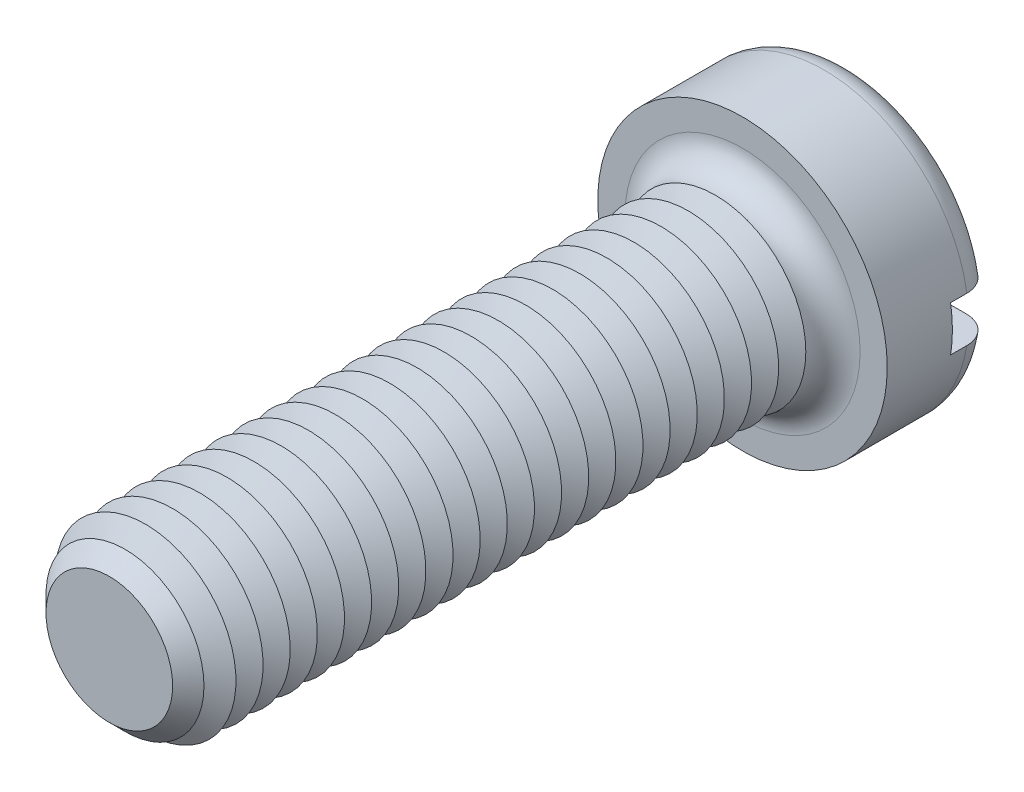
ISO-10303-21;
HEADER;
FILE_DESCRIPTION(('STEP AP214'),'2;1');
FILE_NAME('part.step','',(''),(''),'','','');
FILE_SCHEMA(('AUTOMOTIVE_DESIGN { 1 0 10303 214 1 1 1 1 }'));
ENDSEC;
DATA;
#1=APPLICATION_CONTEXT('core data for automotive mechanical design processes');
#2=APPLICATION_PROTOCOL_DEFINITION('international standard','automotive_design',2000,#1);
#3=PRODUCT_CONTEXT('',#1,'mechanical');
#4=PRODUCT('Part','Part','',(#3));
#5=PRODUCT_RELATED_PRODUCT_CATEGORY('part','',(#4));
#6=PRODUCT_DEFINITION_FORMATION('','',#4);
#7=PRODUCT_DEFINITION_CONTEXT('part definition',#1,'design');
#8=PRODUCT_DEFINITION('design','',#6,#7);
#9=PRODUCT_DEFINITION_SHAPE('','',#8);
#10=(LENGTH_UNIT() NAMED_UNIT(*) SI_UNIT(.MILLI.,.METRE.));
#11=(NAMED_UNIT(*) PLANE_ANGLE_UNIT() SI_UNIT($,.RADIAN.));
#12=(NAMED_UNIT(*) SI_UNIT($,.STERADIAN.) SOLID_ANGLE_UNIT());
#13=UNCERTAINTY_MEASURE_WITH_UNIT(LENGTH_MEASURE(1.E-05),#10,'distance_accuracy_value','');
#14=(GEOMETRIC_REPRESENTATION_CONTEXT(3) GLOBAL_UNCERTAINTY_ASSIGNED_CONTEXT((#13)) GLOBAL_UNIT_ASSIGNED_CONTEXT((#10,
#11,#12)) REPRESENTATION_CONTEXT('',''));
#15=CARTESIAN_POINT('',(0.,0.,0.));
#16=DIRECTION('',(0.,0.,1.));
#17=DIRECTION('',(1.,0.,0.));
#18=AXIS2_PLACEMENT_3D('',#15,#16,#17);
#19=CARTESIAN_POINT('',(0.,0.,-6.));
#20=DIRECTION('',(0.,0.,1.));
#21=DIRECTION('',(1.,0.,0.));
#22=AXIS2_PLACEMENT_3D('',#19,#20,#21);
#23=PLANE('',#22);
#24=CARTESIAN_POINT('',(0.,0.,-6.));
#25=DIRECTION('',(0.,0.,1.));
#26=DIRECTION('',(1.,0.,0.));
#27=AXIS2_PLACEMENT_3D('',#24,#25,#26);
#28=CIRCLE('',#27,6.5);
#29=CARTESIAN_POINT('',(-6.37867541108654,1.25,-6.));
#30=VERTEX_POINT('',#29);
#31=CARTESIAN_POINT('',(6.37867541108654,1.25,-6.));
#32=VERTEX_POINT('',#31);
#33=EDGE_CURVE('E116',#30,#32,#28,.F.);
#34=ORIENTED_EDGE('',*,*,#33,.T.);
#35=DIRECTION('',(1.,0.,0.));
#36=VECTOR('',#35,1.);
#37=CARTESIAN_POINT('',(-8.,1.25,-6.));
#38=LINE('',#37,#36);
#39=EDGE_CURVE('E111',#30,#32,#38,.T.);
#40=ORIENTED_EDGE('',*,*,#39,.F.);
#41=EDGE_LOOP('',(#34,#40));
#42=FACE_BOUND('',#41,.T.);
#43=ADVANCED_FACE('F39',(#42),#23,.F.);
#44=CARTESIAN_POINT('',(0.,0.,-4.5));
#45=DIRECTION('',(0.,0.,1.));
#46=DIRECTION('',(1.,0.,0.));
#47=AXIS2_PLACEMENT_3D('',#44,#45,#46);
#48=TOROIDAL_SURFACE('',#47,6.5,1.5);
#49=CARTESIAN_POINT('',(-7.63778128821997,1.25,-5.34492908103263));
#50=CARTESIAN_POINT('',(-7.58949199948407,1.25,-5.41482553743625));
#51=CARTESIAN_POINT('',(-7.53520056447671,1.25,-5.48065698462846));
#52=CARTESIAN_POINT('',(-7.41624971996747,1.25,-5.60228223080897));
#53=CARTESIAN_POINT('',(-7.35157642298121,1.25,-5.65806236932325));
#54=CARTESIAN_POINT('',(-7.21387612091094,1.25,-5.75795436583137));
#55=CARTESIAN_POINT('',(-7.14085828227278,1.25,-5.80207885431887));
#56=CARTESIAN_POINT('',(-6.98853766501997,1.25,-5.87758013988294));
#57=CARTESIAN_POINT('',(-6.90923642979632,1.25,-5.90896005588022));
#58=CARTESIAN_POINT('',(-6.74565677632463,1.25,-5.95849861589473));
#59=CARTESIAN_POINT('',(-6.66133328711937,1.25,-5.97650838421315));
#60=CARTESIAN_POINT('',(-6.49086565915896,1.25,-5.99833509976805));
#61=CARTESIAN_POINT('',(-6.40472129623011,1.25,-6.00215028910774));
#62=CARTESIAN_POINT('',(-6.23174891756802,1.25,-5.99550457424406));
#63=CARTESIAN_POINT('',(-6.14492874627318,1.25,-5.98483870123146));
#64=CARTESIAN_POINT('',(-5.97427268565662,1.25,-5.94920077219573));
#65=CARTESIAN_POINT('',(-5.89043699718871,1.25,-5.92422775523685));
#66=CARTESIAN_POINT('',(-5.72747580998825,1.25,-5.86041051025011));
#67=CARTESIAN_POINT('',(-5.64839123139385,1.25,-5.8214616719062));
#68=CARTESIAN_POINT('',(-5.49793182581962,1.25,-5.73076137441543));
#69=CARTESIAN_POINT('',(-5.42655700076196,1.25,-5.6790099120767));
#70=CARTESIAN_POINT('',(-5.29410028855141,1.25,-5.56444713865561));
#71=CARTESIAN_POINT('',(-5.23295591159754,1.25,-5.50170815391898));
#72=CARTESIAN_POINT('',(-5.12236155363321,1.25,-5.36664720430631));
#73=CARTESIAN_POINT('',(-5.07291010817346,1.25,-5.29432644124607));
#74=CARTESIAN_POINT('',(-4.98836421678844,1.25,-5.14389152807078));
#75=CARTESIAN_POINT('',(-4.95296843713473,1.25,-5.0659468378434));
#76=CARTESIAN_POINT('',(-4.89620356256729,1.25,-4.90510804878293));
#77=CARTESIAN_POINT('',(-4.87483169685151,1.25,-4.82221493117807));
#78=CARTESIAN_POINT('',(-4.8472995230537,1.25,-4.65636387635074));
#79=CARTESIAN_POINT('',(-4.84072446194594,1.25,-4.57347463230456));
#80=CARTESIAN_POINT('',(-4.84179430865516,1.25,-4.40779255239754));
#81=CARTESIAN_POINT('',(-4.84943782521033,1.25,-4.32499970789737));
#82=CARTESIAN_POINT('',(-4.87846819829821,1.25,-4.16301415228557));
#83=CARTESIAN_POINT('',(-4.89966978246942,1.25,-4.08378809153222));
#84=CARTESIAN_POINT('',(-4.95491528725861,1.25,-3.92995334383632));
#85=CARTESIAN_POINT('',(-4.98895983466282,1.25,-3.85534488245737));
#86=CARTESIAN_POINT('',(-5.06928242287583,1.25,-3.71183790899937));
#87=CARTESIAN_POINT('',(-5.11570495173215,1.25,-3.64302036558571));
#88=CARTESIAN_POINT('',(-5.21915370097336,1.25,-3.51388372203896));
#89=CARTESIAN_POINT('',(-5.27618132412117,1.25,-3.45356574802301));
#90=CARTESIAN_POINT('',(-5.40090076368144,1.25,-3.34137671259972));
#91=CARTESIAN_POINT('',(-5.46884305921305,1.25,-3.28978408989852));
#92=CARTESIAN_POINT('',(-5.61225757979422,1.25,-3.19841811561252));
#93=CARTESIAN_POINT('',(-5.68773079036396,1.25,-3.15864631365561));
#94=CARTESIAN_POINT('',(-5.84602026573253,1.25,-3.09111626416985));
#95=CARTESIAN_POINT('',(-5.92896901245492,1.25,-3.06366820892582));
#96=CARTESIAN_POINT('',(-6.09827849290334,1.25,-3.02294686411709));
#97=CARTESIAN_POINT('',(-6.18463944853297,1.25,-3.00967449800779));
#98=CARTESIAN_POINT('',(-6.35914138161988,1.25,-2.99765063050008));
#99=CARTESIAN_POINT('',(-6.4472913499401,1.25,-2.99902877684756));
#100=CARTESIAN_POINT('',(-6.62209547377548,1.25,-3.01665363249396));
#101=CARTESIAN_POINT('',(-6.70874965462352,1.25,-3.03290008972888));
#102=CARTESIAN_POINT('',(-6.87754008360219,1.25,-3.07975247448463));
#103=CARTESIAN_POINT('',(-6.95969991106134,1.25,-3.11027336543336));
#104=CARTESIAN_POINT('',(-7.11762200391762,1.25,-3.18486653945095));
#105=CARTESIAN_POINT('',(-7.19338469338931,1.25,-3.22893792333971));
#106=CARTESIAN_POINT('',(-7.33522754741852,1.25,-3.32873457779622));
#107=CARTESIAN_POINT('',(-7.40142768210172,1.25,-3.38428930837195));
#108=CARTESIAN_POINT('',(-7.52338344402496,1.25,-3.50587739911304));
#109=CARTESIAN_POINT('',(-7.5791399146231,1.25,-3.57190991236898));
#110=CARTESIAN_POINT('',(-7.67774856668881,1.25,-3.71151097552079));
#111=CARTESIAN_POINT('',(-7.72078137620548,1.25,-3.7849519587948));
#112=CARTESIAN_POINT('',(-7.79373860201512,1.25,-3.93807617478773));
#113=CARTESIAN_POINT('',(-7.82366445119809,1.25,-4.01775872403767));
#114=CARTESIAN_POINT('',(-7.86922494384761,1.25,-4.1801114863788));
#115=CARTESIAN_POINT('',(-7.88502105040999,1.25,-4.26273642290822));
#116=CARTESIAN_POINT('',(-7.90243332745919,1.25,-4.42948977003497));
#117=CARTESIAN_POINT('',(-7.90404643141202,1.25,-4.51361850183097));
#118=CARTESIAN_POINT('',(-7.89306914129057,1.25,-4.68049925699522));
#119=CARTESIAN_POINT('',(-7.88055163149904,1.25,-4.76325613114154));
#120=CARTESIAN_POINT('',(-7.84181179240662,1.25,-4.92542124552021));
#121=CARTESIAN_POINT('',(-7.81560657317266,1.25,-5.00483353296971));
#122=CARTESIAN_POINT('',(-7.76329893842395,1.25,-5.12766777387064));
#123=CARTESIAN_POINT('',(-7.74127773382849,1.25,-5.17287245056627));
#124=CARTESIAN_POINT('',(-7.69279783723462,1.25,-5.26083500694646));
#125=CARTESIAN_POINT('',(-7.66633917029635,1.25,-5.30359290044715));
#126=CARTESIAN_POINT('',(-7.63778128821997,1.25,-5.34492908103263));
#127=B_SPLINE_CURVE_WITH_KNOTS('',3,(#49,#50,#51,#52,#53,#54,#55,#56,#57,#58,#59,#60,#61,#62,
#63,#64,#65,#66,#67,#68,#69,#70,#71,#72,#73,#74,#75,#76,#77,#78,#79,#80,#81,#82,#83,#84,#85,#86,
#87,#88,#89,#90,#91,#92,#93,#94,#95,#96,#97,#98,#99,#100,#101,#102,#103,#104,#105,#106,#107,
#108,#109,#110,#111,#112,#113,#114,#115,#116,#117,#118,#119,#120,#121,#122,#123,#124,#125,#126),
.UNSPECIFIED.,.T.,.F.,(4,2,2,2,2,2,2,2,2,2,2,2,2,2,2,2,2,2,2,2,2,2,2,2,2,2,2,2,2,2,2,2,2,2,2,2,
2,2,4),(0.,0.254678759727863,0.509701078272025,0.764445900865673,1.01912834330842,
1.27660578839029,1.53411511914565,1.7953075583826,2.05651754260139,2.31972495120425,
2.58293242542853,2.84446831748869,3.10597143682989,3.36151874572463,3.61701554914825,
3.86525656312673,4.11347328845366,4.35836855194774,4.60327576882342,4.8511774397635,
5.0991119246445,5.35387584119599,5.60867314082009,5.86956650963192,6.13047687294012,
6.39369803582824,6.65691473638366,6.91858297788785,7.18023385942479,7.43824706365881,
7.69623942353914,7.95037087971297,8.20447454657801,8.45563599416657,8.70685174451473,
8.95677764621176,9.20639187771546,9.35700761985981,9.50762251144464),.UNSPECIFIED.);
#128=CARTESIAN_POINT('',(-7.90174031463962,1.25,-4.50000000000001));
#129=VERTEX_POINT('',#128);
#130=EDGE_CURVE('E361',#129,#30,#127,.T.);
#131=ORIENTED_EDGE('',*,*,#130,.F.);
#132=CARTESIAN_POINT('',(0.,0.,-4.5));
#133=DIRECTION('',(0.,0.,1.));
#134=DIRECTION('',(1.,0.,0.));
#135=AXIS2_PLACEMENT_3D('',#132,#133,#134);
#136=CIRCLE('',#135,8.);
#137=CARTESIAN_POINT('',(7.90174031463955,1.25,-4.5));
#138=VERTEX_POINT('',#137);
#139=EDGE_CURVE('E125',#138,#129,#136,.T.);
#140=ORIENTED_EDGE('',*,*,#139,.F.);
#141=CARTESIAN_POINT('',(4.95236709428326,1.25,-5.05808354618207));
#142=CARTESIAN_POINT('',(4.98477386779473,1.25,-5.13646278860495));
#143=CARTESIAN_POINT('',(5.02397623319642,1.25,-5.21210974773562));
#144=CARTESIAN_POINT('',(5.11464829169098,1.25,-5.35575180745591));
#145=CARTESIAN_POINT('',(5.16613670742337,1.25,-5.42373499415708));
#146=CARTESIAN_POINT('',(5.27963080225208,1.25,-5.55005899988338));
#147=CARTESIAN_POINT('',(5.34161871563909,1.25,-5.60841578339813));
#148=CARTESIAN_POINT('',(5.47431803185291,1.25,-5.71412381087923));
#149=CARTESIAN_POINT('',(5.545027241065,1.25,-5.76147781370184));
#150=CARTESIAN_POINT('',(5.69469818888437,1.25,-5.84486022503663));
#151=CARTESIAN_POINT('',(5.77379661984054,1.25,-5.88064336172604));
#152=CARTESIAN_POINT('',(5.93682776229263,1.25,-5.93863952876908));
#153=CARTESIAN_POINT('',(6.02076112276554,1.25,-5.96085073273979));
#154=CARTESIAN_POINT('',(6.19235911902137,1.25,-5.99130732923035));
#155=CARTESIAN_POINT('',(6.2800597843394,1.25,-5.99935025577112));
#156=CARTESIAN_POINT('',(6.45556807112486,1.25,-6.00057400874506));
#157=CARTESIAN_POINT('',(6.54337569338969,1.25,-5.99375472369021));
#158=CARTESIAN_POINT('',(6.71642471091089,1.25,-5.96539034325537));
#159=CARTESIAN_POINT('',(6.8016703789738,1.25,-5.94387137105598));
#160=CARTESIAN_POINT('',(6.96726399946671,1.25,-5.8866508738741));
#161=CARTESIAN_POINT('',(7.04761223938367,1.25,-5.85095018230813));
#162=CARTESIAN_POINT('',(7.2000703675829,1.25,-5.7668235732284));
#163=CARTESIAN_POINT('',(7.27226868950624,1.25,-5.71855796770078));
#164=CARTESIAN_POINT('',(7.40737382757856,1.25,-5.61041520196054));
#165=CARTESIAN_POINT('',(7.47028138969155,1.25,-5.55053897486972));
#166=CARTESIAN_POINT('',(7.5840004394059,1.25,-5.42185995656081));
#167=CARTESIAN_POINT('',(7.63498189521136,1.25,-5.35320736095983));
#168=CARTESIAN_POINT('',(7.72451646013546,1.25,-5.20822613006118));
#169=CARTESIAN_POINT('',(7.76307051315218,1.25,-5.13189807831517));
#170=CARTESIAN_POINT('',(7.82615156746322,1.25,-4.97479919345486));
#171=CARTESIAN_POINT('',(7.85085353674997,1.25,-4.89409858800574));
#172=CARTESIAN_POINT('',(7.88624162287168,1.25,-4.72968126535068));
#173=CARTESIAN_POINT('',(7.89692844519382,1.25,-4.64596470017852));
#174=CARTESIAN_POINT('',(7.90393395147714,1.25,-4.47857496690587));
#175=CARTESIAN_POINT('',(7.900361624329,1.25,-4.39490633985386));
#176=CARTESIAN_POINT('',(7.8792027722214,1.25,-4.22936201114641));
#177=CARTESIAN_POINT('',(7.86161649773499,1.25,-4.14748627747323));
#178=CARTESIAN_POINT('',(7.81298565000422,1.25,-3.98793539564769));
#179=CARTESIAN_POINT('',(7.78195585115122,1.25,-3.91025574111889));
#180=CARTESIAN_POINT('',(7.70736418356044,1.25,-3.76116938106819));
#181=CARTESIAN_POINT('',(7.66380211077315,1.25,-3.68976277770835));
#182=CARTESIAN_POINT('',(7.56515173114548,1.25,-3.55480889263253));
#183=CARTESIAN_POINT('',(7.51000119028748,1.25,-3.49130712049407));
#184=CARTESIAN_POINT('',(7.38992820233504,1.25,-3.3743390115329));
#185=CARTESIAN_POINT('',(7.32500529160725,1.25,-3.32087315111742));
#186=CARTESIAN_POINT('',(7.18646521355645,1.25,-3.22483712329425));
#187=CARTESIAN_POINT('',(7.11275872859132,1.25,-3.18239583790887));
#188=CARTESIAN_POINT('',(6.95934489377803,1.25,-3.11028530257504));
#189=CARTESIAN_POINT('',(6.87963710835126,1.25,-3.08061698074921));
#190=CARTESIAN_POINT('',(6.71523243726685,1.25,-3.03442872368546));
#191=CARTESIAN_POINT('',(6.63047940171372,1.25,-3.0181086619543));
#192=CARTESIAN_POINT('',(6.45944163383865,1.25,-2.99971307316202));
#193=CARTESIAN_POINT('',(6.37315677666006,1.25,-2.99763871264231));
#194=CARTESIAN_POINT('',(6.20021063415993,1.25,-3.00779604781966));
#195=CARTESIAN_POINT('',(6.11356117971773,1.25,-3.02022976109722));
#196=CARTESIAN_POINT('',(5.94354092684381,1.25,-3.05935975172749));
#197=CARTESIAN_POINT('',(5.86017035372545,1.25,-3.08605700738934));
#198=CARTESIAN_POINT('',(5.69848536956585,1.25,-3.15322746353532));
#199=CARTESIAN_POINT('',(5.62021039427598,1.25,-3.1937956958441));
#200=CARTESIAN_POINT('',(5.47164170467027,1.25,-3.28758816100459));
#201=CARTESIAN_POINT('',(5.40134797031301,1.25,-3.3408123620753));
#202=CARTESIAN_POINT('',(5.27136483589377,1.25,-3.45806317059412));
#203=CARTESIAN_POINT('',(5.21160120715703,1.25,-3.52200740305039));
#204=CARTESIAN_POINT('',(5.10396941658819,1.25,-3.65922833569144));
#205=CARTESIAN_POINT('',(5.05609917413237,1.25,-3.73250340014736));
#206=CARTESIAN_POINT('',(4.97487058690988,1.25,-3.8844714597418));
#207=CARTESIAN_POINT('',(4.94119529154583,1.25,-3.96299495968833));
#208=CARTESIAN_POINT('',(4.88793322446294,1.25,-4.12470694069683));
#209=CARTESIAN_POINT('',(4.86834741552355,1.25,-4.20789574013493));
#210=CARTESIAN_POINT('',(4.84433446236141,1.25,-4.3740749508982));
#211=CARTESIAN_POINT('',(4.83950391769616,1.25,-4.45700748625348));
#212=CARTESIAN_POINT('',(4.84404021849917,1.25,-4.62240731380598));
#213=CARTESIAN_POINT('',(4.85338770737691,1.25,-4.70487508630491));
#214=CARTESIAN_POINT('',(4.87895619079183,1.25,-4.83246978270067));
#215=CARTESIAN_POINT('',(4.89056704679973,1.25,-4.87856970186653));
#216=CARTESIAN_POINT('',(4.91819711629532,1.25,-4.96942661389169));
#217=CARTESIAN_POINT('',(4.93421619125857,1.25,-5.01418364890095));
#218=CARTESIAN_POINT('',(4.95236709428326,1.25,-5.05808354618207));
#219=B_SPLINE_CURVE_WITH_KNOTS('',3,(#141,#142,#143,#144,#145,#146,#147,#148,#149,#150,#151,
#152,#153,#154,#155,#156,#157,#158,#159,#160,#161,#162,#163,#164,#165,#166,#167,#168,#169,#170,
#171,#172,#173,#174,#175,#176,#177,#178,#179,#180,#181,#182,#183,#184,#185,#186,#187,#188,#189,
#190,#191,#192,#193,#194,#195,#196,#197,#198,#199,#200,#201,#202,#203,#204,#205,#206,#207,#208,
#209,#210,#211,#212,#213,#214,#215,#216,#217,#218),.UNSPECIFIED.,.T.,.F.,(4,2,2,2,2,2,2,2,2,2,2,
2,2,2,2,2,2,2,2,2,2,2,2,2,2,2,2,2,2,2,2,2,2,2,2,2,2,2,4),(0.,0.25426396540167,0.508917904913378,
0.763145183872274,1.01730864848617,1.27655188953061,1.53583000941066,1.79878406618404,
2.06174009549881,2.32423003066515,2.5867045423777,2.84598168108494,3.10523799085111,
3.36053725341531,3.61581712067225,3.8677953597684,4.11976091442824,4.36980428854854,
4.61984319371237,4.86960800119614,5.11937687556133,5.37052303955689,5.62168112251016,
5.87565515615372,6.12964764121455,6.38737709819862,6.64512765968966,6.90651052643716,
7.16791132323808,7.43114013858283,7.69436829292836,7.95565940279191,8.21690477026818,
8.47196060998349,8.72703387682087,8.97506819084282,9.22276418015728,9.36518087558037,
9.50759309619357),.UNSPECIFIED.);
#220=EDGE_CURVE('E363',#32,#138,#219,.T.);
#221=ORIENTED_EDGE('',*,*,#220,.F.);
#222=ORIENTED_EDGE('',*,*,#33,.F.);
#223=EDGE_LOOP('',(#131,#140,#221,#222));
#224=FACE_BOUND('',#223,.T.);
#225=ADVANCED_FACE('F345',(#224),#48,.T.);
#226=CARTESIAN_POINT('',(0.,0.,-6.));
#227=DIRECTION('',(0.,0.,1.));
#228=DIRECTION('',(1.,0.,0.));
#229=AXIS2_PLACEMENT_3D('',#226,#227,#228);
#230=CYLINDRICAL_SURFACE('',#229,8.);
#231=DIRECTION('',(0.,0.,1.));
#232=VECTOR('',#231,1.);
#233=CARTESIAN_POINT('',(7.90174031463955,1.25,-6.));
#234=LINE('',#233,#232);
#235=CARTESIAN_POINT('',(7.90174031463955,1.25,-3.6));
#236=VERTEX_POINT('',#235);
#237=EDGE_CURVE('E379',#138,#236,#234,.T.);
#238=ORIENTED_EDGE('',*,*,#237,.F.);
#239=ORIENTED_EDGE('',*,*,#139,.T.);
#240=DIRECTION('',(0.,0.,1.));
#241=VECTOR('',#240,1.);
#242=CARTESIAN_POINT('',(-7.90174031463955,1.25,-6.));
#243=LINE('',#242,#241);
#244=CARTESIAN_POINT('',(-7.90174031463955,1.25,-3.6));
#245=VERTEX_POINT('',#244);
#246=EDGE_CURVE('E63',#245,#129,#243,.F.);
#247=ORIENTED_EDGE('',*,*,#246,.F.);
#248=CARTESIAN_POINT('',(0.,0.,-3.6));
#249=DIRECTION('',(0.,0.,-1.));
#250=DIRECTION('',(-1.,0.,0.));
#251=AXIS2_PLACEMENT_3D('',#248,#249,#250);
#252=CIRCLE('',#251,8.);
#253=CARTESIAN_POINT('',(-7.90174031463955,-1.25,-3.6));
#254=VERTEX_POINT('',#253);
#255=EDGE_CURVE('E43',#245,#254,#252,.F.);
#256=ORIENTED_EDGE('',*,*,#255,.T.);
#257=DIRECTION('',(0.,0.,1.));
#258=VECTOR('',#257,1.);
#259=CARTESIAN_POINT('',(-7.90174031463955,-1.25,-6.));
#260=LINE('',#259,#258);
#261=CARTESIAN_POINT('',(-7.9017403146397,-1.25,-4.49999999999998));
#262=VERTEX_POINT('',#261);
#263=EDGE_CURVE('E376',#262,#254,#260,.T.);
#264=ORIENTED_EDGE('',*,*,#263,.F.);
#265=CARTESIAN_POINT('',(7.90174031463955,-1.25,-4.5));
#266=VERTEX_POINT('',#265);
#267=EDGE_CURVE('E127',#262,#266,#136,.T.);
#268=ORIENTED_EDGE('',*,*,#267,.T.);
#269=DIRECTION('',(0.,0.,1.));
#270=VECTOR('',#269,1.);
#271=CARTESIAN_POINT('',(7.90174031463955,-1.25,-6.));
#272=LINE('',#271,#270);
#273=CARTESIAN_POINT('',(7.90174031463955,-1.25,-3.6));
#274=VERTEX_POINT('',#273);
#275=EDGE_CURVE('E55',#274,#266,#272,.F.);
#276=ORIENTED_EDGE('',*,*,#275,.F.);
#277=EDGE_CURVE('E11',#274,#236,#252,.F.);
#278=ORIENTED_EDGE('',*,*,#277,.T.);
#279=EDGE_LOOP('',(#238,#239,#247,#256,#264,#268,#276,#278));
#280=FACE_BOUND('',#279,.T.);
#281=CARTESIAN_POINT('',(0.,0.,0.));
#282=DIRECTION('',(0.,0.,1.));
#283=DIRECTION('',(1.,0.,0.));
#284=AXIS2_PLACEMENT_3D('',#281,#282,#283);
#285=CIRCLE('',#284,8.);
#286=CARTESIAN_POINT('',(8.,0.,0.));
#287=VERTEX_POINT('',#286);
#288=EDGE_CURVE('E382',#287,#287,#285,.T.);
#289=ORIENTED_EDGE('',*,*,#288,.F.);
#290=EDGE_LOOP('',(#289));
#291=FACE_BOUND('',#290,.T.);
#292=ADVANCED_FACE('F341',(#280,#291),#230,.T.);
#293=CARTESIAN_POINT('',(6.37867541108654,-1.25,-6.));
#294=VERTEX_POINT('',#293);
#295=CARTESIAN_POINT('',(-6.37867541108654,-1.25,-6.));
#296=VERTEX_POINT('',#295);
#297=EDGE_CURVE('E109',#294,#296,#28,.F.);
#298=ORIENTED_EDGE('',*,*,#297,.T.);
#299=DIRECTION('',(-1.,0.,0.));
#300=VECTOR('',#299,1.);
#301=CARTESIAN_POINT('',(-8.,-1.25,-6.));
#302=LINE('',#301,#300);
#303=EDGE_CURVE('E96',#294,#296,#302,.T.);
#304=ORIENTED_EDGE('',*,*,#303,.F.);
#305=EDGE_LOOP('',(#298,#304));
#306=FACE_BOUND('',#305,.T.);
#307=ADVANCED_FACE('F108',(#306),#23,.F.);
#308=CARTESIAN_POINT('',(0.,0.,0.));
#309=DIRECTION('',(0.,0.,1.));
#310=DIRECTION('',(1.,0.,0.));
#311=AXIS2_PLACEMENT_3D('',#308,#309,#310);
#312=PLANE('',#311);
#313=CARTESIAN_POINT('',(0.,0.,0.));
#314=DIRECTION('',(0.,0.,1.));
#315=DIRECTION('',(1.,0.,0.));
#316=AXIS2_PLACEMENT_3D('',#313,#314,#315);
#317=CIRCLE('',#316,6.5);
#318=CARTESIAN_POINT('',(6.5,0.,0.));
#319=VERTEX_POINT('',#318);
#320=EDGE_CURVE('E115',#319,#319,#317,.F.);
#321=ORIENTED_EDGE('',*,*,#320,.T.);
#322=EDGE_LOOP('',(#321));
#323=FACE_BOUND('',#322,.T.);
#324=ORIENTED_EDGE('',*,*,#288,.T.);
#325=EDGE_LOOP('',(#324));
#326=FACE_BOUND('',#325,.T.);
#327=ADVANCED_FACE('F340',(#323,#326),#312,.T.);
#328=CARTESIAN_POINT('',(-7.63778128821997,-1.25,-5.34492908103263));
#329=CARTESIAN_POINT('',(-7.68527581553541,-1.25,-5.27616964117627));
#330=CARTESIAN_POINT('',(-7.72703224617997,-1.25,-5.20337764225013));
#331=CARTESIAN_POINT('',(-7.79778035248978,-1.25,-5.05176511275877));
#332=CARTESIAN_POINT('',(-7.82675823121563,-1.25,-4.97293817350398));
#333=CARTESIAN_POINT('',(-7.87103239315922,-1.25,-4.81153865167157));
#334=CARTESIAN_POINT('',(-7.8863313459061,-1.25,-4.72896680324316));
#335=CARTESIAN_POINT('',(-7.90278562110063,-1.25,-4.56244566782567));
#336=CARTESIAN_POINT('',(-7.90394420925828,-1.25,-4.4784967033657));
#337=CARTESIAN_POINT('',(-7.89211470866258,-1.25,-4.31190980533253));
#338=CARTESIAN_POINT('',(-7.87917806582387,-1.25,-4.22926821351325));
#339=CARTESIAN_POINT('',(-7.8396278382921,-1.25,-4.06732477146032));
#340=CARTESIAN_POINT('',(-7.81301388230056,-1.25,-3.98802301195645));
#341=CARTESIAN_POINT('',(-7.74686575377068,-1.25,-3.83490116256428));
#342=CARTESIAN_POINT('',(-7.70731700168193,-1.25,-3.76108737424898));
#343=CARTESIAN_POINT('',(-7.61647675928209,-1.25,-3.62108231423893));
#344=CARTESIAN_POINT('',(-7.56518496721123,-1.25,-3.55489123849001));
#345=CARTESIAN_POINT('',(-7.45192141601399,-1.25,-3.43145488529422));
#346=CARTESIAN_POINT('',(-7.3898717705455,-1.25,-3.37428109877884));
#347=CARTESIAN_POINT('',(-7.25715883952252,-1.25,-3.27100737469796));
#348=CARTESIAN_POINT('',(-7.18649507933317,-1.25,-3.22490804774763));
#349=CARTESIAN_POINT('',(-7.03760898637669,-1.25,-3.14445316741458));
#350=CARTESIAN_POINT('',(-6.95930204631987,-1.25,-3.1102542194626));
#351=CARTESIAN_POINT('',(-6.79811453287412,-1.25,-3.05526915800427));
#352=CARTESIAN_POINT('',(-6.71523359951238,-1.25,-3.03448410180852));
#353=CARTESIAN_POINT('',(-6.5459165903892,-1.25,-3.006592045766));
#354=CARTESIAN_POINT('',(-6.45944575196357,-1.25,-2.99969602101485));
#355=CARTESIAN_POINT('',(-6.28655568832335,-1.25,-3.00032465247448));
#356=CARTESIAN_POINT('',(-6.20013646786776,-1.25,-3.00785047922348));
#357=CARTESIAN_POINT('',(-6.02865505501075,-1.25,-3.03725742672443));
#358=CARTESIAN_POINT('',(-5.94362352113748,-1.25,-3.05931758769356));
#359=CARTESIAN_POINT('',(-5.77844448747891,-1.25,-3.11735373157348));
#360=CARTESIAN_POINT('',(-5.69829723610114,-1.25,-3.15333042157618));
#361=CARTESIAN_POINT('',(-5.54495924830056,-1.25,-3.23837037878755));
#362=CARTESIAN_POINT('',(-5.47178958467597,-1.25,-3.28747168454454));
#363=CARTESIAN_POINT('',(-5.33486536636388,-1.25,-3.39741183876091));
#364=CARTESIAN_POINT('',(-5.27111040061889,-1.25,-3.45825017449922));
#365=CARTESIAN_POINT('',(-5.15579778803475,-1.25,-3.58914722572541));
#366=CARTESIAN_POINT('',(-5.10409113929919,-1.25,-3.65907455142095));
#367=CARTESIAN_POINT('',(-5.01353659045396,-1.25,-3.8068142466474));
#368=CARTESIAN_POINT('',(-4.97468647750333,-1.25,-3.88462525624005));
#369=CARTESIAN_POINT('',(-4.91208858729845,-1.25,-4.04366636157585));
#370=CARTESIAN_POINT('',(-4.88795969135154,-1.25,-4.12474643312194));
#371=CARTESIAN_POINT('',(-4.85404909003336,-1.25,-4.28985038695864));
#372=CARTESIAN_POINT('',(-4.84426486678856,-1.25,-4.37387374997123));
#373=CARTESIAN_POINT('',(-4.83946276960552,-1.25,-4.54023897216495));
#374=CARTESIAN_POINT('',(-4.8440833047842,-1.25,-4.62257060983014));
#375=CARTESIAN_POINT('',(-4.86713763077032,-1.25,-4.78527148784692));
#376=CARTESIAN_POINT('',(-4.88557092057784,-1.25,-4.86564079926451));
#377=CARTESIAN_POINT('',(-4.9355229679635,-1.25,-5.02189555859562));
#378=CARTESIAN_POINT('',(-4.9669975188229,-1.25,-5.09779517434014));
#379=CARTESIAN_POINT('',(-5.04199393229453,-1.25,-5.24338322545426));
#380=CARTESIAN_POINT('',(-5.0855168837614,-1.25,-5.31307109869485));
#381=CARTESIAN_POINT('',(-5.18427540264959,-1.25,-5.44580979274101));
#382=CARTESIAN_POINT('',(-5.2397318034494,-1.25,-5.50869620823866));
#383=CARTESIAN_POINT('',(-5.36015301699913,-1.25,-5.62458635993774));
#384=CARTESIAN_POINT('',(-5.42511919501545,-1.25,-5.67758867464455));
#385=CARTESIAN_POINT('',(-5.56469412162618,-1.25,-5.7737610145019));
#386=CARTESIAN_POINT('',(-5.6395232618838,-1.25,-5.81661133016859));
#387=CARTESIAN_POINT('',(-5.79521544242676,-1.25,-5.8894110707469));
#388=CARTESIAN_POINT('',(-5.8760791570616,-1.25,-5.91935905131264));
#389=CARTESIAN_POINT('',(-6.04317815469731,-1.25,-5.9660059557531));
#390=CARTESIAN_POINT('',(-6.12948555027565,-1.25,-5.98244700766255));
#391=CARTESIAN_POINT('',(-6.30363462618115,-1.25,-6.00064866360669));
#392=CARTESIAN_POINT('',(-6.39147629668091,-1.25,-6.00240936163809));
#393=CARTESIAN_POINT('',(-6.5664192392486,-1.25,-5.9911248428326));
#394=CARTESIAN_POINT('',(-6.653518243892,-1.25,-5.9780442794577));
#395=CARTESIAN_POINT('',(-6.82426167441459,-1.25,-5.93729204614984));
#396=CARTESIAN_POINT('',(-6.90790538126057,-1.25,-5.90961735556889));
#397=CARTESIAN_POINT('',(-7.06846412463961,-1.25,-5.84071272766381));
#398=CARTESIAN_POINT('',(-7.14543542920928,-1.25,-5.79961377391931));
#399=CARTESIAN_POINT('',(-7.29116896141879,-1.25,-5.70491210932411));
#400=CARTESIAN_POINT('',(-7.35994165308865,-1.25,-5.65132560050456));
#401=CARTESIAN_POINT('',(-7.46362894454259,-1.25,-5.55509815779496));
#402=CARTESIAN_POINT('',(-7.50165191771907,-1.25,-5.51575032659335));
#403=CARTESIAN_POINT('',(-7.57319530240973,-1.25,-5.43315308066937));
#404=CARTESIAN_POINT('',(-7.60671575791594,-1.25,-5.38990370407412));
#405=CARTESIAN_POINT('',(-7.63778128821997,-1.25,-5.34492908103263));
#406=B_SPLINE_CURVE_WITH_KNOTS('',3,(#328,#329,#330,#331,#332,#333,#334,#335,#336,#337,#338,
#339,#340,#341,#342,#343,#344,#345,#346,#347,#348,#349,#350,#351,#352,#353,#354,#355,#356,#357,
#358,#359,#360,#361,#362,#363,#364,#365,#366,#367,#368,#369,#370,#371,#372,#373,#374,#375,#376,
#377,#378,#379,#380,#381,#382,#383,#384,#385,#386,#387,#388,#389,#390,#391,#392,#393,#394,#395,
#396,#397,#398,#399,#400,#401,#402,#403,#404,#405),.UNSPECIFIED.,.T.,.F.,(4,2,2,2,2,2,2,2,2,2,2,
2,2,2,2,2,2,2,2,2,2,2,2,2,2,2,2,2,2,2,2,2,2,2,2,2,2,2,4),(0.,0.250506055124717,
0.501281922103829,0.752008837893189,1.00267784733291,1.25243500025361,1.50219893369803,
1.75224536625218,2.00229822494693,2.25424343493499,2.50620253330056,2.76136198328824,
3.01654154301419,3.27556891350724,3.53461730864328,3.79691797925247,4.05923197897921,
4.32231463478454,4.5853858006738,4.84500678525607,5.10458306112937,5.3571172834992,
5.60960717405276,5.85581050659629,6.10200490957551,6.34737151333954,6.59276029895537,
6.84315522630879,7.09358613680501,7.35108485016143,7.60861238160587,7.87094926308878,
8.13328446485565,8.39624576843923,8.65926152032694,8.91978401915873,9.17997036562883,
9.34382460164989,9.50767723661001),.UNSPECIFIED.);
#407=EDGE_CURVE('E103',#296,#262,#406,.T.);
#408=ORIENTED_EDGE('',*,*,#407,.F.);
#409=ORIENTED_EDGE('',*,*,#297,.F.);
#410=CARTESIAN_POINT('',(4.95236709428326,-1.25,-5.05808354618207));
#411=CARTESIAN_POINT('',(4.92105512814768,-1.25,-4.98233216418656));
#412=CARTESIAN_POINT('',(4.89604361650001,-1.25,-4.90392040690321));
#413=CARTESIAN_POINT('',(4.85951223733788,-1.25,-4.74395758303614));
#414=CARTESIAN_POINT('',(4.8480045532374,-1.25,-4.66240375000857));
#415=CARTESIAN_POINT('',(4.83891469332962,-1.25,-4.49852199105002));
#416=CARTESIAN_POINT('',(4.84133145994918,-1.25,-4.41619412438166));
#417=CARTESIAN_POINT('',(4.8600038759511,-1.25,-4.25314313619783));
#418=CARTESIAN_POINT('',(4.87625705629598,-1.25,-4.17241973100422));
#419=CARTESIAN_POINT('',(4.92196554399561,-1.25,-4.01505032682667));
#420=CARTESIAN_POINT('',(4.95138456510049,-1.25,-3.93839376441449));
#421=CARTESIAN_POINT('',(5.02244158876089,-1.25,-3.79097367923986));
#422=CARTESIAN_POINT('',(5.06408092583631,-1.25,-3.72021080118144));
#423=CARTESIAN_POINT('',(5.15918188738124,-1.25,-3.5851203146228));
#424=CARTESIAN_POINT('',(5.21285223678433,-1.25,-3.5209397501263));
#425=CARTESIAN_POINT('',(5.32993512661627,-1.25,-3.40218700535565));
#426=CARTESIAN_POINT('',(5.39334903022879,-1.25,-3.34761617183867));
#427=CARTESIAN_POINT('',(5.5300552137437,-1.25,-3.24801679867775));
#428=CARTESIAN_POINT('',(5.60357647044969,-1.25,-3.20330242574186));
#429=CARTESIAN_POINT('',(5.75697062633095,-1.25,-3.1265687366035));
#430=CARTESIAN_POINT('',(5.83684424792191,-1.25,-3.09455086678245));
#431=CARTESIAN_POINT('',(6.00239031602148,-1.25,-3.04353393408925));
#432=CARTESIAN_POINT('',(6.08814636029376,-1.25,-3.02480570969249));
#433=CARTESIAN_POINT('',(6.26158564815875,-1.25,-3.00194915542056));
#434=CARTESIAN_POINT('',(6.34926896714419,-1.25,-2.997821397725));
#435=CARTESIAN_POINT('',(6.52441816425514,-1.25,-3.00435236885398));
#436=CARTESIAN_POINT('',(6.61188199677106,-1.25,-3.01506655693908));
#437=CARTESIAN_POINT('',(6.78373130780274,-1.25,-3.05116556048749));
#438=CARTESIAN_POINT('',(6.8681168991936,-1.25,-3.07654983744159));
#439=CARTESIAN_POINT('',(7.03056473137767,-1.25,-3.14105639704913));
#440=CARTESIAN_POINT('',(7.10867812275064,-1.25,-3.18004978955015));
#441=CARTESIAN_POINT('',(7.25711285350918,-1.25,-3.27078804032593));
#442=CARTESIAN_POINT('',(7.327434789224,-1.25,-3.32253192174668));
#443=CARTESIAN_POINT('',(7.45716954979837,-1.25,-3.4364775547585));
#444=CARTESIAN_POINT('',(7.51672925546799,-1.25,-3.49851206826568));
#445=CARTESIAN_POINT('',(7.62440498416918,-1.25,-3.63182557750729));
#446=CARTESIAN_POINT('',(7.67252193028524,-1.25,-3.70310382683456));
#447=CARTESIAN_POINT('',(7.75523498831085,-1.25,-3.8517825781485));
#448=CARTESIAN_POINT('',(7.79001407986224,-1.25,-3.92908131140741));
#449=CARTESIAN_POINT('',(7.84595474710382,-1.25,-4.08845836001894));
#450=CARTESIAN_POINT('',(7.86711715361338,-1.25,-4.1705363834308));
#451=CARTESIAN_POINT('',(7.89503817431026,-1.25,-4.3362768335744));
#452=CARTESIAN_POINT('',(7.90193595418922,-1.25,-4.41991584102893));
#453=CARTESIAN_POINT('',(7.90153623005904,-1.25,-4.58715860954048));
#454=CARTESIAN_POINT('',(7.89423915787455,-1.25,-4.67076237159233));
#455=CARTESIAN_POINT('',(7.86572271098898,-1.25,-4.83525080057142));
#456=CARTESIAN_POINT('',(7.84455307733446,-1.25,-4.91614410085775));
#457=CARTESIAN_POINT('',(7.78897430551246,-1.25,-5.0732444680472));
#458=CARTESIAN_POINT('',(7.75456511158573,-1.25,-5.1494515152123));
#459=CARTESIAN_POINT('',(7.67339923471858,-1.25,-5.29528903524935));
#460=CARTESIAN_POINT('',(7.62660424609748,-1.25,-5.36489817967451));
#461=CARTESIAN_POINT('',(7.52209201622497,-1.25,-5.49536318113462));
#462=CARTESIAN_POINT('',(7.4643743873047,-1.25,-5.55621872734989));
#463=CARTESIAN_POINT('',(7.33909994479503,-1.25,-5.66807257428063));
#464=CARTESIAN_POINT('',(7.27145672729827,-1.25,-5.71897407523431));
#465=CARTESIAN_POINT('',(7.12868060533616,-1.25,-5.80887807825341));
#466=CARTESIAN_POINT('',(7.0535472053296,-1.25,-5.84787979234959));
#467=CARTESIAN_POINT('',(6.89682225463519,-1.25,-5.91345911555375));
#468=CARTESIAN_POINT('',(6.81515596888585,-1.25,-5.93985808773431));
#469=CARTESIAN_POINT('',(6.64858434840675,-1.25,-5.97879449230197));
#470=CARTESIAN_POINT('',(6.56367874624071,-1.25,-5.99133077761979));
#471=CARTESIAN_POINT('',(6.39168259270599,-1.25,-6.00236627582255));
#472=CARTESIAN_POINT('',(6.30457835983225,-1.25,-6.00065255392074));
#473=CARTESIAN_POINT('',(6.13186422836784,-1.25,-5.98278857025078));
#474=CARTESIAN_POINT('',(6.04625438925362,-1.25,-5.96663773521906));
#475=CARTESIAN_POINT('',(5.87802521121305,-1.25,-5.92012173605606));
#476=CARTESIAN_POINT('',(5.79544617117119,-1.25,-5.88961066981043));
#477=CARTESIAN_POINT('',(5.63656223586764,-1.25,-5.81513349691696));
#478=CARTESIAN_POINT('',(5.56025908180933,-1.25,-5.77116367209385));
#479=CARTESIAN_POINT('',(5.4162607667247,-1.25,-5.67098882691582));
#480=CARTESIAN_POINT('',(5.34855795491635,-1.25,-5.61479480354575));
#481=CARTESIAN_POINT('',(5.22382615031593,-1.25,-5.49168804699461));
#482=CARTESIAN_POINT('',(5.16678340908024,-1.25,-5.42478932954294));
#483=CARTESIAN_POINT('',(5.08326589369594,-1.25,-5.3075481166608));
#484=CARTESIAN_POINT('',(5.05313168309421,-1.25,-5.25976959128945));
#485=CARTESIAN_POINT('',(4.99845900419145,-1.25,-5.16110869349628));
#486=CARTESIAN_POINT('',(4.9739204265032,-1.25,-5.11022638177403));
#487=CARTESIAN_POINT('',(4.95236709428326,-1.25,-5.05808354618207));
#488=B_SPLINE_CURVE_WITH_KNOTS('',3,(#410,#411,#412,#413,#414,#415,#416,#417,#418,#419,#420,
#421,#422,#423,#424,#425,#426,#427,#428,#429,#430,#431,#432,#433,#434,#435,#436,#437,#438,#439,
#440,#441,#442,#443,#444,#445,#446,#447,#448,#449,#450,#451,#452,#453,#454,#455,#456,#457,#458,
#459,#460,#461,#462,#463,#464,#465,#466,#467,#468,#469,#470,#471,#472,#473,#474,#475,#476,#477,
#478,#479,#480,#481,#482,#483,#484,#485,#486,#487),.UNSPECIFIED.,.T.,.F.,(4,2,2,2,2,2,2,2,2,2,2,
2,2,2,2,2,2,2,2,2,2,2,2,2,2,2,2,2,2,2,2,2,2,2,2,2,2,2,4),(0.,0.245701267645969,
0.491624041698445,0.737528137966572,0.983388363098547,1.22857510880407,1.47378864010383,
1.72364048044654,1.97352730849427,2.2304941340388,2.48749022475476,2.74958408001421,
3.01168820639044,3.2747743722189,3.53785088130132,3.79850056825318,4.05913029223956,
4.31587819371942,4.57260537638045,4.82567253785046,5.07872425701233,5.32929532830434,
5.57985877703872,5.82952869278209,6.07919966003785,6.32965199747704,6.58011322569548,
6.8329006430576,7.08570479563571,7.3419930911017,7.59830259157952,7.85844887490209,
8.11860548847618,8.38146435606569,8.64439590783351,8.90709189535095,9.16944670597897,
9.33857644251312,9.5077028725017),.UNSPECIFIED.);
#489=EDGE_CURVE('E92',#266,#294,#488,.T.);
#490=ORIENTED_EDGE('',*,*,#489,.F.);
#491=ORIENTED_EDGE('',*,*,#267,.F.);
#492=EDGE_LOOP('',(#408,#409,#490,#491));
#493=FACE_BOUND('',#492,.T.);
#494=ADVANCED_FACE('F113',(#493),#48,.T.);
#495=CARTESIAN_POINT('',(0.,0.,1.5));
#496=DIRECTION('',(0.,0.,1.));
#497=DIRECTION('',(1.,0.,0.));
#498=AXIS2_PLACEMENT_3D('',#495,#496,#497);
#499=TOROIDAL_SURFACE('',#498,6.5,1.5);
#500=ORIENTED_EDGE('',*,*,#320,.F.);
#501=EDGE_LOOP('',(#500));
#502=FACE_BOUND('',#501,.T.);
#503=CARTESIAN_POINT('',(0.,0.,1.5));
#504=DIRECTION('',(0.,0.,-1.));
#505=DIRECTION('',(-1.,0.,0.));
#506=AXIS2_PLACEMENT_3D('',#503,#504,#505);
#507=CIRCLE('',#506,5.);
#508=CARTESIAN_POINT('',(-5.,0.,1.5));
#509=VERTEX_POINT('',#508);
#510=EDGE_CURVE('E387',#509,#509,#507,.T.);
#511=ORIENTED_EDGE('',*,*,#510,.T.);
#512=EDGE_LOOP('',(#511));
#513=FACE_BOUND('',#512,.T.);
#514=ADVANCED_FACE('F333',(#502,#513),#499,.F.);
#515=CARTESIAN_POINT('',(0.,0.,2.25));
#516=DIRECTION('',(0.,0.,-1.));
#517=DIRECTION('',(-1.,0.,0.));
#518=AXIS2_PLACEMENT_3D('',#515,#516,#517);
#519=CONICAL_SURFACE('',#518,3.70096189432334,1.0471975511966);
#520=ORIENTED_EDGE('',*,*,#510,.F.);
#521=EDGE_LOOP('',(#520));
#522=FACE_BOUND('',#521,.T.);
#523=CARTESIAN_POINT('',(0.,0.,2.25));
#524=DIRECTION('',(0.,0.,-1.));
#525=DIRECTION('',(-1.,0.,0.));
#526=AXIS2_PLACEMENT_3D('',#523,#524,#525);
#527=CIRCLE('',#526,3.70096189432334);
#528=CARTESIAN_POINT('',(-3.70096189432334,0.,2.25));
#529=VERTEX_POINT('',#528);
#530=EDGE_CURVE('E394',#529,#529,#527,.T.);
#531=ORIENTED_EDGE('',*,*,#530,.T.);
#532=EDGE_LOOP('',(#531));
#533=FACE_BOUND('',#532,.T.);
#534=ADVANCED_FACE('F329',(#522,#533),#519,.T.);
#535=CARTESIAN_POINT('',(0.,0.,3.));
#536=DIRECTION('',(0.,0.,1.));
#537=DIRECTION('',(1.,0.,0.));
#538=AXIS2_PLACEMENT_3D('',#535,#536,#537);
#539=CONICAL_SURFACE('',#538,5.,1.0471975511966);
#540=ORIENTED_EDGE('',*,*,#530,.F.);
#541=EDGE_LOOP('',(#540));
#542=FACE_BOUND('',#541,.T.);
#543=CARTESIAN_POINT('',(0.,0.,3.));
#544=DIRECTION('',(0.,0.,-1.));
#545=DIRECTION('',(-1.,0.,0.));
#546=AXIS2_PLACEMENT_3D('',#543,#544,#545);
#547=CIRCLE('',#546,5.);
#548=CARTESIAN_POINT('',(-5.,0.,3.));
#549=VERTEX_POINT('',#548);
#550=EDGE_CURVE('E399',#549,#549,#547,.T.);
#551=ORIENTED_EDGE('',*,*,#550,.T.);
#552=EDGE_LOOP('',(#551));
#553=FACE_BOUND('',#552,.T.);
#554=ADVANCED_FACE('F325',(#542,#553),#539,.T.);
#555=CARTESIAN_POINT('',(0.,0.,3.75));
#556=DIRECTION('',(0.,0.,-1.));
#557=DIRECTION('',(-1.,0.,0.));
#558=AXIS2_PLACEMENT_3D('',#555,#556,#557);
#559=CONICAL_SURFACE('',#558,3.70096189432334,1.0471975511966);
#560=ORIENTED_EDGE('',*,*,#550,.F.);
#561=EDGE_LOOP('',(#560));
#562=FACE_BOUND('',#561,.T.);
#563=CARTESIAN_POINT('',(0.,0.,3.75));
#564=DIRECTION('',(0.,0.,-1.));
#565=DIRECTION('',(-1.,0.,0.));
#566=AXIS2_PLACEMENT_3D('',#563,#564,#565);
#567=CIRCLE('',#566,3.70096189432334);
#568=CARTESIAN_POINT('',(-3.70096189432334,0.,3.75));
#569=VERTEX_POINT('',#568);
#570=EDGE_CURVE('E402',#569,#569,#567,.T.);
#571=ORIENTED_EDGE('',*,*,#570,.T.);
#572=EDGE_LOOP('',(#571));
#573=FACE_BOUND('',#572,.T.);
#574=ADVANCED_FACE('F321',(#562,#573),#559,.T.);
#575=CARTESIAN_POINT('',(0.,0.,4.5));
#576=DIRECTION('',(0.,0.,1.));
#577=DIRECTION('',(1.,0.,0.));
#578=AXIS2_PLACEMENT_3D('',#575,#576,#577);
#579=CONICAL_SURFACE('',#578,5.,1.0471975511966);
#580=ORIENTED_EDGE('',*,*,#570,.F.);
#581=EDGE_LOOP('',(#580));
#582=FACE_BOUND('',#581,.T.);
#583=CARTESIAN_POINT('',(0.,0.,4.5));
#584=DIRECTION('',(0.,0.,-1.));
#585=DIRECTION('',(-1.,0.,0.));
#586=AXIS2_PLACEMENT_3D('',#583,#584,#585);
#587=CIRCLE('',#586,5.);
#588=CARTESIAN_POINT('',(-5.,0.,4.5));
#589=VERTEX_POINT('',#588);
#590=EDGE_CURVE('E406',#589,#589,#587,.T.);
#591=ORIENTED_EDGE('',*,*,#590,.T.);
#592=EDGE_LOOP('',(#591));
#593=FACE_BOUND('',#592,.T.);
#594=ADVANCED_FACE('F317',(#582,#593),#579,.T.);
#595=CARTESIAN_POINT('',(0.,0.,5.25));
#596=DIRECTION('',(0.,0.,-1.));
#597=DIRECTION('',(-1.,0.,0.));
#598=AXIS2_PLACEMENT_3D('',#595,#596,#597);
#599=CONICAL_SURFACE('',#598,3.70096189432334,1.0471975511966);
#600=ORIENTED_EDGE('',*,*,#590,.F.);
#601=EDGE_LOOP('',(#600));
#602=FACE_BOUND('',#601,.T.);
#603=CARTESIAN_POINT('',(0.,0.,5.25));
#604=DIRECTION('',(0.,0.,-1.));
#605=DIRECTION('',(-1.,0.,0.));
#606=AXIS2_PLACEMENT_3D('',#603,#604,#605);
#607=CIRCLE('',#606,3.70096189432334);
#608=CARTESIAN_POINT('',(-3.70096189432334,0.,5.25));
#609=VERTEX_POINT('',#608);
#610=EDGE_CURVE('E409',#609,#609,#607,.T.);
#611=ORIENTED_EDGE('',*,*,#610,.T.);
#612=EDGE_LOOP('',(#611));
#613=FACE_BOUND('',#612,.T.);
#614=ADVANCED_FACE('F313',(#602,#613),#599,.T.);
#615=CARTESIAN_POINT('',(0.,0.,6.));
#616=DIRECTION('',(0.,0.,1.));
#617=DIRECTION('',(1.,0.,0.));
#618=AXIS2_PLACEMENT_3D('',#615,#616,#617);
#619=CONICAL_SURFACE('',#618,5.,1.0471975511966);
#620=ORIENTED_EDGE('',*,*,#610,.F.);
#621=EDGE_LOOP('',(#620));
#622=FACE_BOUND('',#621,.T.);
#623=CARTESIAN_POINT('',(0.,0.,6.));
#624=DIRECTION('',(0.,0.,-1.));
#625=DIRECTION('',(-1.,0.,0.));
#626=AXIS2_PLACEMENT_3D('',#623,#624,#625);
#627=CIRCLE('',#626,5.);
#628=CARTESIAN_POINT('',(-5.,0.,6.));
#629=VERTEX_POINT('',#628);
#630=EDGE_CURVE('E413',#629,#629,#627,.T.);
#631=ORIENTED_EDGE('',*,*,#630,.T.);
#632=EDGE_LOOP('',(#631));
#633=FACE_BOUND('',#632,.T.);
#634=ADVANCED_FACE('F309',(#622,#633),#619,.T.);
#635=CARTESIAN_POINT('',(0.,0.,6.75));
#636=DIRECTION('',(0.,0.,-1.));
#637=DIRECTION('',(-1.,0.,0.));
#638=AXIS2_PLACEMENT_3D('',#635,#636,#637);
#639=CONICAL_SURFACE('',#638,3.70096189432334,1.0471975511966);
#640=ORIENTED_EDGE('',*,*,#630,.F.);
#641=EDGE_LOOP('',(#640));
#642=FACE_BOUND('',#641,.T.);
#643=CARTESIAN_POINT('',(0.,0.,6.75));
#644=DIRECTION('',(0.,0.,-1.));
#645=DIRECTION('',(-1.,0.,0.));
#646=AXIS2_PLACEMENT_3D('',#643,#644,#645);
#647=CIRCLE('',#646,3.70096189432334);
#648=CARTESIAN_POINT('',(-3.70096189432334,0.,6.75));
#649=VERTEX_POINT('',#648);
#650=EDGE_CURVE('E417',#649,#649,#647,.T.);
#651=ORIENTED_EDGE('',*,*,#650,.T.);
#652=EDGE_LOOP('',(#651));
#653=FACE_BOUND('',#652,.T.);
#654=ADVANCED_FACE('F305',(#642,#653),#639,.T.);
#655=CARTESIAN_POINT('',(0.,0.,7.5));
#656=DIRECTION('',(0.,0.,1.));
#657=DIRECTION('',(1.,0.,0.));
#658=AXIS2_PLACEMENT_3D('',#655,#656,#657);
#659=CONICAL_SURFACE('',#658,5.,1.0471975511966);
#660=ORIENTED_EDGE('',*,*,#650,.F.);
#661=EDGE_LOOP('',(#660));
#662=FACE_BOUND('',#661,.T.);
#663=CARTESIAN_POINT('',(0.,0.,7.5));
#664=DIRECTION('',(0.,0.,-1.));
#665=DIRECTION('',(-1.,0.,0.));
#666=AXIS2_PLACEMENT_3D('',#663,#664,#665);
#667=CIRCLE('',#666,5.);
#668=CARTESIAN_POINT('',(-5.,0.,7.5));
#669=VERTEX_POINT('',#668);
#670=EDGE_CURVE('E420',#669,#669,#667,.T.);
#671=ORIENTED_EDGE('',*,*,#670,.T.);
#672=EDGE_LOOP('',(#671));
#673=FACE_BOUND('',#672,.T.);
#674=ADVANCED_FACE('F301',(#662,#673),#659,.T.);
#675=CARTESIAN_POINT('',(0.,0.,8.25));
#676=DIRECTION('',(0.,0.,-1.));
#677=DIRECTION('',(-1.,0.,0.));
#678=AXIS2_PLACEMENT_3D('',#675,#676,#677);
#679=CONICAL_SURFACE('',#678,3.70096189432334,1.0471975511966);
#680=ORIENTED_EDGE('',*,*,#670,.F.);
#681=EDGE_LOOP('',(#680));
#682=FACE_BOUND('',#681,.T.);
#683=CARTESIAN_POINT('',(0.,0.,8.25));
#684=DIRECTION('',(0.,0.,-1.));
#685=DIRECTION('',(-1.,0.,0.));
#686=AXIS2_PLACEMENT_3D('',#683,#684,#685);
#687=CIRCLE('',#686,3.70096189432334);
#688=CARTESIAN_POINT('',(-3.70096189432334,0.,8.25));
#689=VERTEX_POINT('',#688);
#690=EDGE_CURVE('E424',#689,#689,#687,.T.);
#691=ORIENTED_EDGE('',*,*,#690,.T.);
#692=EDGE_LOOP('',(#691));
#693=FACE_BOUND('',#692,.T.);
#694=ADVANCED_FACE('F297',(#682,#693),#679,.T.);
#695=CARTESIAN_POINT('',(0.,0.,9.));
#696=DIRECTION('',(0.,0.,1.));
#697=DIRECTION('',(1.,0.,0.));
#698=AXIS2_PLACEMENT_3D('',#695,#696,#697);
#699=CONICAL_SURFACE('',#698,5.,1.0471975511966);
#700=ORIENTED_EDGE('',*,*,#690,.F.);
#701=EDGE_LOOP('',(#700));
#702=FACE_BOUND('',#701,.T.);
#703=CARTESIAN_POINT('',(0.,0.,9.));
#704=DIRECTION('',(0.,0.,-1.));
#705=DIRECTION('',(-1.,0.,0.));
#706=AXIS2_PLACEMENT_3D('',#703,#704,#705);
#707=CIRCLE('',#706,5.);
#708=CARTESIAN_POINT('',(-5.,0.,9.));
#709=VERTEX_POINT('',#708);
#710=EDGE_CURVE('E428',#709,#709,#707,.T.);
#711=ORIENTED_EDGE('',*,*,#710,.T.);
#712=EDGE_LOOP('',(#711));
#713=FACE_BOUND('',#712,.T.);
#714=ADVANCED_FACE('F293',(#702,#713),#699,.T.);
#715=CARTESIAN_POINT('',(0.,0.,9.75));
#716=DIRECTION('',(0.,0.,-1.));
#717=DIRECTION('',(-1.,0.,0.));
#718=AXIS2_PLACEMENT_3D('',#715,#716,#717);
#719=CONICAL_SURFACE('',#718,3.70096189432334,1.0471975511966);
#720=ORIENTED_EDGE('',*,*,#710,.F.);
#721=EDGE_LOOP('',(#720));
#722=FACE_BOUND('',#721,.T.);
#723=CARTESIAN_POINT('',(0.,0.,9.75));
#724=DIRECTION('',(0.,0.,-1.));
#725=DIRECTION('',(-1.,0.,0.));
#726=AXIS2_PLACEMENT_3D('',#723,#724,#725);
#727=CIRCLE('',#726,3.70096189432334);
#728=CARTESIAN_POINT('',(-3.70096189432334,0.,9.75));
#729=VERTEX_POINT('',#728);
#730=EDGE_CURVE('E432',#729,#729,#727,.T.);
#731=ORIENTED_EDGE('',*,*,#730,.T.);
#732=EDGE_LOOP('',(#731));
#733=FACE_BOUND('',#732,.T.);
#734=ADVANCED_FACE('F289',(#722,#733),#719,.T.);
#735=CARTESIAN_POINT('',(0.,0.,10.5));
#736=DIRECTION('',(0.,0.,1.));
#737=DIRECTION('',(1.,0.,0.));
#738=AXIS2_PLACEMENT_3D('',#735,#736,#737);
#739=CONICAL_SURFACE('',#738,5.,1.0471975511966);
#740=ORIENTED_EDGE('',*,*,#730,.F.);
#741=EDGE_LOOP('',(#740));
#742=FACE_BOUND('',#741,.T.);
#743=CARTESIAN_POINT('',(0.,0.,10.5));
#744=DIRECTION('',(0.,0.,-1.));
#745=DIRECTION('',(-1.,0.,0.));
#746=AXIS2_PLACEMENT_3D('',#743,#744,#745);
#747=CIRCLE('',#746,5.);
#748=CARTESIAN_POINT('',(-5.,0.,10.5));
#749=VERTEX_POINT('',#748);
#750=EDGE_CURVE('E436',#749,#749,#747,.T.);
#751=ORIENTED_EDGE('',*,*,#750,.T.);
#752=EDGE_LOOP('',(#751));
#753=FACE_BOUND('',#752,.T.);
#754=ADVANCED_FACE('F285',(#742,#753),#739,.T.);
#755=CARTESIAN_POINT('',(0.,0.,11.25));
#756=DIRECTION('',(0.,0.,-1.));
#757=DIRECTION('',(-1.,0.,0.));
#758=AXIS2_PLACEMENT_3D('',#755,#756,#757);
#759=CONICAL_SURFACE('',#758,3.70096189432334,1.0471975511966);
#760=ORIENTED_EDGE('',*,*,#750,.F.);
#761=EDGE_LOOP('',(#760));
#762=FACE_BOUND('',#761,.T.);
#763=CARTESIAN_POINT('',(0.,0.,11.25));
#764=DIRECTION('',(0.,0.,-1.));
#765=DIRECTION('',(-1.,0.,0.));
#766=AXIS2_PLACEMENT_3D('',#763,#764,#765);
#767=CIRCLE('',#766,3.70096189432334);
#768=CARTESIAN_POINT('',(-3.70096189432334,0.,11.25));
#769=VERTEX_POINT('',#768);
#770=EDGE_CURVE('E440',#769,#769,#767,.T.);
#771=ORIENTED_EDGE('',*,*,#770,.T.);
#772=EDGE_LOOP('',(#771));
#773=FACE_BOUND('',#772,.T.);
#774=ADVANCED_FACE('F281',(#762,#773),#759,.T.);
#775=CARTESIAN_POINT('',(0.,0.,12.));
#776=DIRECTION('',(0.,0.,1.));
#777=DIRECTION('',(1.,0.,0.));
#778=AXIS2_PLACEMENT_3D('',#775,#776,#777);
#779=CONICAL_SURFACE('',#778,5.,1.0471975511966);
#780=ORIENTED_EDGE('',*,*,#770,.F.);
#781=EDGE_LOOP('',(#780));
#782=FACE_BOUND('',#781,.T.);
#783=CARTESIAN_POINT('',(0.,0.,12.));
#784=DIRECTION('',(0.,0.,-1.));
#785=DIRECTION('',(-1.,0.,0.));
#786=AXIS2_PLACEMENT_3D('',#783,#784,#785);
#787=CIRCLE('',#786,5.);
#788=CARTESIAN_POINT('',(-5.,0.,12.));
#789=VERTEX_POINT('',#788);
#790=EDGE_CURVE('E443',#789,#789,#787,.T.);
#791=ORIENTED_EDGE('',*,*,#790,.T.);
#792=EDGE_LOOP('',(#791));
#793=FACE_BOUND('',#792,.T.);
#794=ADVANCED_FACE('F277',(#782,#793),#779,.T.);
#795=CARTESIAN_POINT('',(0.,0.,12.75));
#796=DIRECTION('',(0.,0.,-1.));
#797=DIRECTION('',(-1.,0.,0.));
#798=AXIS2_PLACEMENT_3D('',#795,#796,#797);
#799=CONICAL_SURFACE('',#798,3.70096189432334,1.0471975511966);
#800=ORIENTED_EDGE('',*,*,#790,.F.);
#801=EDGE_LOOP('',(#800));
#802=FACE_BOUND('',#801,.T.);
#803=CARTESIAN_POINT('',(0.,0.,12.75));
#804=DIRECTION('',(0.,0.,-1.));
#805=DIRECTION('',(-1.,0.,0.));
#806=AXIS2_PLACEMENT_3D('',#803,#804,#805);
#807=CIRCLE('',#806,3.70096189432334);
#808=CARTESIAN_POINT('',(-3.70096189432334,0.,12.75));
#809=VERTEX_POINT('',#808);
#810=EDGE_CURVE('E447',#809,#809,#807,.T.);
#811=ORIENTED_EDGE('',*,*,#810,.T.);
#812=EDGE_LOOP('',(#811));
#813=FACE_BOUND('',#812,.T.);
#814=ADVANCED_FACE('F273',(#802,#813),#799,.T.);
#815=CARTESIAN_POINT('',(0.,0.,13.5));
#816=DIRECTION('',(0.,0.,1.));
#817=DIRECTION('',(1.,0.,0.));
#818=AXIS2_PLACEMENT_3D('',#815,#816,#817);
#819=CONICAL_SURFACE('',#818,5.,1.0471975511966);
#820=ORIENTED_EDGE('',*,*,#810,.F.);
#821=EDGE_LOOP('',(#820));
#822=FACE_BOUND('',#821,.T.);
#823=CARTESIAN_POINT('',(0.,0.,13.5));
#824=DIRECTION('',(0.,0.,-1.));
#825=DIRECTION('',(-1.,0.,0.));
#826=AXIS2_PLACEMENT_3D('',#823,#824,#825);
#827=CIRCLE('',#826,5.);
#828=CARTESIAN_POINT('',(-5.,0.,13.5));
#829=VERTEX_POINT('',#828);
#830=EDGE_CURVE('E451',#829,#829,#827,.T.);
#831=ORIENTED_EDGE('',*,*,#830,.T.);
#832=EDGE_LOOP('',(#831));
#833=FACE_BOUND('',#832,.T.);
#834=ADVANCED_FACE('F269',(#822,#833),#819,.T.);
#835=CARTESIAN_POINT('',(0.,0.,14.25));
#836=DIRECTION('',(0.,0.,-1.));
#837=DIRECTION('',(-1.,0.,0.));
#838=AXIS2_PLACEMENT_3D('',#835,#836,#837);
#839=CONICAL_SURFACE('',#838,3.70096189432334,1.0471975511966);
#840=ORIENTED_EDGE('',*,*,#830,.F.);
#841=EDGE_LOOP('',(#840));
#842=FACE_BOUND('',#841,.T.);
#843=CARTESIAN_POINT('',(0.,0.,14.25));
#844=DIRECTION('',(0.,0.,-1.));
#845=DIRECTION('',(-1.,0.,0.));
#846=AXIS2_PLACEMENT_3D('',#843,#844,#845);
#847=CIRCLE('',#846,3.70096189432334);
#848=CARTESIAN_POINT('',(-3.70096189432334,0.,14.25));
#849=VERTEX_POINT('',#848);
#850=EDGE_CURVE('E455',#849,#849,#847,.T.);
#851=ORIENTED_EDGE('',*,*,#850,.T.);
#852=EDGE_LOOP('',(#851));
#853=FACE_BOUND('',#852,.T.);
#854=ADVANCED_FACE('F265',(#842,#853),#839,.T.);
#855=CARTESIAN_POINT('',(0.,0.,15.));
#856=DIRECTION('',(0.,0.,1.));
#857=DIRECTION('',(1.,0.,0.));
#858=AXIS2_PLACEMENT_3D('',#855,#856,#857);
#859=CONICAL_SURFACE('',#858,5.,1.0471975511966);
#860=ORIENTED_EDGE('',*,*,#850,.F.);
#861=EDGE_LOOP('',(#860));
#862=FACE_BOUND('',#861,.T.);
#863=CARTESIAN_POINT('',(0.,0.,15.));
#864=DIRECTION('',(0.,0.,-1.));
#865=DIRECTION('',(-1.,0.,0.));
#866=AXIS2_PLACEMENT_3D('',#863,#864,#865);
#867=CIRCLE('',#866,5.);
#868=CARTESIAN_POINT('',(-5.,0.,15.));
#869=VERTEX_POINT('',#868);
#870=EDGE_CURVE('E459',#869,#869,#867,.T.);
#871=ORIENTED_EDGE('',*,*,#870,.T.);
#872=EDGE_LOOP('',(#871));
#873=FACE_BOUND('',#872,.T.);
#874=ADVANCED_FACE('F261',(#862,#873),#859,.T.);
#875=CARTESIAN_POINT('',(0.,0.,15.75));
#876=DIRECTION('',(0.,0.,-1.));
#877=DIRECTION('',(-1.,0.,0.));
#878=AXIS2_PLACEMENT_3D('',#875,#876,#877);
#879=CONICAL_SURFACE('',#878,3.70096189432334,1.0471975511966);
#880=ORIENTED_EDGE('',*,*,#870,.F.);
#881=EDGE_LOOP('',(#880));
#882=FACE_BOUND('',#881,.T.);
#883=CARTESIAN_POINT('',(0.,0.,15.75));
#884=DIRECTION('',(0.,0.,-1.));
#885=DIRECTION('',(-1.,0.,0.));
#886=AXIS2_PLACEMENT_3D('',#883,#884,#885);
#887=CIRCLE('',#886,3.70096189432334);
#888=CARTESIAN_POINT('',(-3.70096189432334,0.,15.75));
#889=VERTEX_POINT('',#888);
#890=EDGE_CURVE('E463',#889,#889,#887,.T.);
#891=ORIENTED_EDGE('',*,*,#890,.T.);
#892=EDGE_LOOP('',(#891));
#893=FACE_BOUND('',#892,.T.);
#894=ADVANCED_FACE('F257',(#882,#893),#879,.T.);
#895=CARTESIAN_POINT('',(0.,0.,16.5));
#896=DIRECTION('',(0.,0.,1.));
#897=DIRECTION('',(1.,0.,0.));
#898=AXIS2_PLACEMENT_3D('',#895,#896,#897);
#899=CONICAL_SURFACE('',#898,5.,1.0471975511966);
#900=ORIENTED_EDGE('',*,*,#890,.F.);
#901=EDGE_LOOP('',(#900));
#902=FACE_BOUND('',#901,.T.);
#903=CARTESIAN_POINT('',(0.,0.,16.5));
#904=DIRECTION('',(0.,0.,-1.));
#905=DIRECTION('',(-1.,0.,0.));
#906=AXIS2_PLACEMENT_3D('',#903,#904,#905);
#907=CIRCLE('',#906,5.);
#908=CARTESIAN_POINT('',(-5.,0.,16.5));
#909=VERTEX_POINT('',#908);
#910=EDGE_CURVE('E467',#909,#909,#907,.T.);
#911=ORIENTED_EDGE('',*,*,#910,.T.);
#912=EDGE_LOOP('',(#911));
#913=FACE_BOUND('',#912,.T.);
#914=ADVANCED_FACE('F253',(#902,#913),#899,.T.);
#915=CARTESIAN_POINT('',(0.,0.,17.25));
#916=DIRECTION('',(0.,0.,-1.));
#917=DIRECTION('',(-1.,0.,0.));
#918=AXIS2_PLACEMENT_3D('',#915,#916,#917);
#919=CONICAL_SURFACE('',#918,3.70096189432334,1.0471975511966);
#920=ORIENTED_EDGE('',*,*,#910,.F.);
#921=EDGE_LOOP('',(#920));
#922=FACE_BOUND('',#921,.T.);
#923=CARTESIAN_POINT('',(0.,0.,17.25));
#924=DIRECTION('',(0.,0.,-1.));
#925=DIRECTION('',(-1.,0.,0.));
#926=AXIS2_PLACEMENT_3D('',#923,#924,#925);
#927=CIRCLE('',#926,3.70096189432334);
#928=CARTESIAN_POINT('',(-3.70096189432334,0.,17.25));
#929=VERTEX_POINT('',#928);
#930=EDGE_CURVE('E471',#929,#929,#927,.T.);
#931=ORIENTED_EDGE('',*,*,#930,.T.);
#932=EDGE_LOOP('',(#931));
#933=FACE_BOUND('',#932,.T.);
#934=ADVANCED_FACE('F249',(#922,#933),#919,.T.);
#935=CARTESIAN_POINT('',(0.,0.,18.));
#936=DIRECTION('',(0.,0.,1.));
#937=DIRECTION('',(1.,0.,0.));
#938=AXIS2_PLACEMENT_3D('',#935,#936,#937);
#939=CONICAL_SURFACE('',#938,5.,1.0471975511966);
#940=ORIENTED_EDGE('',*,*,#930,.F.);
#941=EDGE_LOOP('',(#940));
#942=FACE_BOUND('',#941,.T.);
#943=CARTESIAN_POINT('',(0.,0.,18.));
#944=DIRECTION('',(0.,0.,-1.));
#945=DIRECTION('',(-1.,0.,0.));
#946=AXIS2_PLACEMENT_3D('',#943,#944,#945);
#947=CIRCLE('',#946,5.);
#948=CARTESIAN_POINT('',(-5.,0.,18.));
#949=VERTEX_POINT('',#948);
#950=EDGE_CURVE('E475',#949,#949,#947,.T.);
#951=ORIENTED_EDGE('',*,*,#950,.T.);
#952=EDGE_LOOP('',(#951));
#953=FACE_BOUND('',#952,.T.);
#954=ADVANCED_FACE('F245',(#942,#953),#939,.T.);
#955=CARTESIAN_POINT('',(0.,0.,18.75));
#956=DIRECTION('',(0.,0.,-1.));
#957=DIRECTION('',(-1.,0.,0.));
#958=AXIS2_PLACEMENT_3D('',#955,#956,#957);
#959=CONICAL_SURFACE('',#958,3.70096189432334,1.0471975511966);
#960=ORIENTED_EDGE('',*,*,#950,.F.);
#961=EDGE_LOOP('',(#960));
#962=FACE_BOUND('',#961,.T.);
#963=CARTESIAN_POINT('',(0.,0.,18.75));
#964=DIRECTION('',(0.,0.,-1.));
#965=DIRECTION('',(-1.,0.,0.));
#966=AXIS2_PLACEMENT_3D('',#963,#964,#965);
#967=CIRCLE('',#966,3.70096189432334);
#968=CARTESIAN_POINT('',(-3.70096189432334,0.,18.75));
#969=VERTEX_POINT('',#968);
#970=EDGE_CURVE('E479',#969,#969,#967,.T.);
#971=ORIENTED_EDGE('',*,*,#970,.T.);
#972=EDGE_LOOP('',(#971));
#973=FACE_BOUND('',#972,.T.);
#974=ADVANCED_FACE('F241',(#962,#973),#959,.T.);
#975=CARTESIAN_POINT('',(0.,0.,19.5));
#976=DIRECTION('',(0.,0.,1.));
#977=DIRECTION('',(1.,0.,0.));
#978=AXIS2_PLACEMENT_3D('',#975,#976,#977);
#979=CONICAL_SURFACE('',#978,5.,1.0471975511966);
#980=ORIENTED_EDGE('',*,*,#970,.F.);
#981=EDGE_LOOP('',(#980));
#982=FACE_BOUND('',#981,.T.);
#983=CARTESIAN_POINT('',(0.,0.,19.5));
#984=DIRECTION('',(0.,0.,-1.));
#985=DIRECTION('',(-1.,0.,0.));
#986=AXIS2_PLACEMENT_3D('',#983,#984,#985);
#987=CIRCLE('',#986,5.);
#988=CARTESIAN_POINT('',(-5.,0.,19.5));
#989=VERTEX_POINT('',#988);
#990=EDGE_CURVE('E483',#989,#989,#987,.T.);
#991=ORIENTED_EDGE('',*,*,#990,.T.);
#992=EDGE_LOOP('',(#991));
#993=FACE_BOUND('',#992,.T.);
#994=ADVANCED_FACE('F237',(#982,#993),#979,.T.);
#995=CARTESIAN_POINT('',(0.,0.,20.25));
#996=DIRECTION('',(0.,0.,-1.));
#997=DIRECTION('',(-1.,0.,0.));
#998=AXIS2_PLACEMENT_3D('',#995,#996,#997);
#999=CONICAL_SURFACE('',#998,3.70096189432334,1.0471975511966);
#1000=ORIENTED_EDGE('',*,*,#990,.F.);
#1001=EDGE_LOOP('',(#1000));
#1002=FACE_BOUND('',#1001,.T.);
#1003=CARTESIAN_POINT('',(0.,0.,20.25));
#1004=DIRECTION('',(0.,0.,-1.));
#1005=DIRECTION('',(-1.,0.,0.));
#1006=AXIS2_PLACEMENT_3D('',#1003,#1004,#1005);
#1007=CIRCLE('',#1006,3.70096189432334);
#1008=CARTESIAN_POINT('',(-3.70096189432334,0.,20.25));
#1009=VERTEX_POINT('',#1008);
#1010=EDGE_CURVE('E487',#1009,#1009,#1007,.T.);
#1011=ORIENTED_EDGE('',*,*,#1010,.T.);
#1012=EDGE_LOOP('',(#1011));
#1013=FACE_BOUND('',#1012,.T.);
#1014=ADVANCED_FACE('F233',(#1002,#1013),#999,.T.);
#1015=CARTESIAN_POINT('',(0.,0.,21.));
#1016=DIRECTION('',(0.,0.,1.));
#1017=DIRECTION('',(1.,0.,0.));
#1018=AXIS2_PLACEMENT_3D('',#1015,#1016,#1017);
#1019=CONICAL_SURFACE('',#1018,5.,1.0471975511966);
#1020=ORIENTED_EDGE('',*,*,#1010,.F.);
#1021=EDGE_LOOP('',(#1020));
#1022=FACE_BOUND('',#1021,.T.);
#1023=CARTESIAN_POINT('',(0.,0.,21.));
#1024=DIRECTION('',(0.,0.,-1.));
#1025=DIRECTION('',(-1.,0.,0.));
#1026=AXIS2_PLACEMENT_3D('',#1023,#1024,#1025);
#1027=CIRCLE('',#1026,5.);
#1028=CARTESIAN_POINT('',(-5.,0.,21.));
#1029=VERTEX_POINT('',#1028);
#1030=EDGE_CURVE('E491',#1029,#1029,#1027,.T.);
#1031=ORIENTED_EDGE('',*,*,#1030,.T.);
#1032=EDGE_LOOP('',(#1031));
#1033=FACE_BOUND('',#1032,.T.);
#1034=ADVANCED_FACE('F229',(#1022,#1033),#1019,.T.);
#1035=CARTESIAN_POINT('',(0.,0.,21.75));
#1036=DIRECTION('',(0.,0.,-1.));
#1037=DIRECTION('',(-1.,0.,0.));
#1038=AXIS2_PLACEMENT_3D('',#1035,#1036,#1037);
#1039=CONICAL_SURFACE('',#1038,3.70096189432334,1.0471975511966);
#1040=ORIENTED_EDGE('',*,*,#1030,.F.);
#1041=EDGE_LOOP('',(#1040));
#1042=FACE_BOUND('',#1041,.T.);
#1043=CARTESIAN_POINT('',(0.,0.,21.75));
#1044=DIRECTION('',(0.,0.,-1.));
#1045=DIRECTION('',(-1.,0.,0.));
#1046=AXIS2_PLACEMENT_3D('',#1043,#1044,#1045);
#1047=CIRCLE('',#1046,3.70096189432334);
#1048=CARTESIAN_POINT('',(-3.70096189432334,0.,21.75));
#1049=VERTEX_POINT('',#1048);
#1050=EDGE_CURVE('E495',#1049,#1049,#1047,.T.);
#1051=ORIENTED_EDGE('',*,*,#1050,.T.);
#1052=EDGE_LOOP('',(#1051));
#1053=FACE_BOUND('',#1052,.T.);
#1054=ADVANCED_FACE('F225',(#1042,#1053),#1039,.T.);
#1055=CARTESIAN_POINT('',(0.,0.,22.5));
#1056=DIRECTION('',(0.,0.,1.));
#1057=DIRECTION('',(1.,0.,0.));
#1058=AXIS2_PLACEMENT_3D('',#1055,#1056,#1057);
#1059=CONICAL_SURFACE('',#1058,5.,1.0471975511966);
#1060=ORIENTED_EDGE('',*,*,#1050,.F.);
#1061=EDGE_LOOP('',(#1060));
#1062=FACE_BOUND('',#1061,.T.);
#1063=CARTESIAN_POINT('',(0.,0.,22.5));
#1064=DIRECTION('',(0.,0.,-1.));
#1065=DIRECTION('',(-1.,0.,0.));
#1066=AXIS2_PLACEMENT_3D('',#1063,#1064,#1065);
#1067=CIRCLE('',#1066,5.);
#1068=CARTESIAN_POINT('',(-5.,0.,22.5));
#1069=VERTEX_POINT('',#1068);
#1070=EDGE_CURVE('E499',#1069,#1069,#1067,.T.);
#1071=ORIENTED_EDGE('',*,*,#1070,.T.);
#1072=EDGE_LOOP('',(#1071));
#1073=FACE_BOUND('',#1072,.T.);
#1074=ADVANCED_FACE('F221',(#1062,#1073),#1059,.T.);
#1075=CARTESIAN_POINT('',(0.,0.,23.25));
#1076=DIRECTION('',(0.,0.,-1.));
#1077=DIRECTION('',(-1.,0.,0.));
#1078=AXIS2_PLACEMENT_3D('',#1075,#1076,#1077);
#1079=CONICAL_SURFACE('',#1078,3.70096189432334,1.0471975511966);
#1080=ORIENTED_EDGE('',*,*,#1070,.F.);
#1081=EDGE_LOOP('',(#1080));
#1082=FACE_BOUND('',#1081,.T.);
#1083=CARTESIAN_POINT('',(0.,0.,23.25));
#1084=DIRECTION('',(0.,0.,-1.));
#1085=DIRECTION('',(-1.,0.,0.));
#1086=AXIS2_PLACEMENT_3D('',#1083,#1084,#1085);
#1087=CIRCLE('',#1086,3.70096189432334);
#1088=CARTESIAN_POINT('',(-3.70096189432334,0.,23.25));
#1089=VERTEX_POINT('',#1088);
#1090=EDGE_CURVE('E503',#1089,#1089,#1087,.T.);
#1091=ORIENTED_EDGE('',*,*,#1090,.T.);
#1092=EDGE_LOOP('',(#1091));
#1093=FACE_BOUND('',#1092,.T.);
#1094=ADVANCED_FACE('F217',(#1082,#1093),#1079,.T.);
#1095=CARTESIAN_POINT('',(0.,0.,24.));
#1096=DIRECTION('',(0.,0.,1.));
#1097=DIRECTION('',(1.,0.,0.));
#1098=AXIS2_PLACEMENT_3D('',#1095,#1096,#1097);
#1099=CONICAL_SURFACE('',#1098,5.,1.0471975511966);
#1100=ORIENTED_EDGE('',*,*,#1090,.F.);
#1101=EDGE_LOOP('',(#1100));
#1102=FACE_BOUND('',#1101,.T.);
#1103=CARTESIAN_POINT('',(0.,0.,24.));
#1104=DIRECTION('',(0.,0.,-1.));
#1105=DIRECTION('',(-1.,0.,0.));
#1106=AXIS2_PLACEMENT_3D('',#1103,#1104,#1105);
#1107=CIRCLE('',#1106,5.);
#1108=CARTESIAN_POINT('',(-5.,0.,24.));
#1109=VERTEX_POINT('',#1108);
#1110=EDGE_CURVE('E506',#1109,#1109,#1107,.T.);
#1111=ORIENTED_EDGE('',*,*,#1110,.T.);
#1112=EDGE_LOOP('',(#1111));
#1113=FACE_BOUND('',#1112,.T.);
#1114=ADVANCED_FACE('F213',(#1102,#1113),#1099,.T.);
#1115=CARTESIAN_POINT('',(0.,0.,24.75));
#1116=DIRECTION('',(0.,0.,-1.));
#1117=DIRECTION('',(-1.,0.,0.));
#1118=AXIS2_PLACEMENT_3D('',#1115,#1116,#1117);
#1119=CONICAL_SURFACE('',#1118,3.70096189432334,1.0471975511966);
#1120=ORIENTED_EDGE('',*,*,#1110,.F.);
#1121=EDGE_LOOP('',(#1120));
#1122=FACE_BOUND('',#1121,.T.);
#1123=CARTESIAN_POINT('',(0.,0.,24.75));
#1124=DIRECTION('',(0.,0.,-1.));
#1125=DIRECTION('',(-1.,0.,0.));
#1126=AXIS2_PLACEMENT_3D('',#1123,#1124,#1125);
#1127=CIRCLE('',#1126,3.70096189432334);
#1128=CARTESIAN_POINT('',(-3.70096189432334,0.,24.75));
#1129=VERTEX_POINT('',#1128);
#1130=EDGE_CURVE('E510',#1129,#1129,#1127,.T.);
#1131=ORIENTED_EDGE('',*,*,#1130,.T.);
#1132=EDGE_LOOP('',(#1131));
#1133=FACE_BOUND('',#1132,.T.);
#1134=ADVANCED_FACE('F209',(#1122,#1133),#1119,.T.);
#1135=CARTESIAN_POINT('',(0.,0.,25.5));
#1136=DIRECTION('',(0.,0.,1.));
#1137=DIRECTION('',(1.,0.,0.));
#1138=AXIS2_PLACEMENT_3D('',#1135,#1136,#1137);
#1139=CONICAL_SURFACE('',#1138,5.,1.0471975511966);
#1140=ORIENTED_EDGE('',*,*,#1130,.F.);
#1141=EDGE_LOOP('',(#1140));
#1142=FACE_BOUND('',#1141,.T.);
#1143=CARTESIAN_POINT('',(0.,0.,25.5));
#1144=DIRECTION('',(0.,0.,-1.));
#1145=DIRECTION('',(-1.,0.,0.));
#1146=AXIS2_PLACEMENT_3D('',#1143,#1144,#1145);
#1147=CIRCLE('',#1146,5.);
#1148=CARTESIAN_POINT('',(-5.,0.,25.5));
#1149=VERTEX_POINT('',#1148);
#1150=EDGE_CURVE('E514',#1149,#1149,#1147,.T.);
#1151=ORIENTED_EDGE('',*,*,#1150,.T.);
#1152=EDGE_LOOP('',(#1151));
#1153=FACE_BOUND('',#1152,.T.);
#1154=ADVANCED_FACE('F205',(#1142,#1153),#1139,.T.);
#1155=CARTESIAN_POINT('',(0.,0.,26.25));
#1156=DIRECTION('',(0.,0.,-1.));
#1157=DIRECTION('',(-1.,0.,0.));
#1158=AXIS2_PLACEMENT_3D('',#1155,#1156,#1157);
#1159=CONICAL_SURFACE('',#1158,3.70096189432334,1.0471975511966);
#1160=ORIENTED_EDGE('',*,*,#1150,.F.);
#1161=EDGE_LOOP('',(#1160));
#1162=FACE_BOUND('',#1161,.T.);
#1163=CARTESIAN_POINT('',(0.,0.,26.25));
#1164=DIRECTION('',(0.,0.,-1.));
#1165=DIRECTION('',(-1.,0.,0.));
#1166=AXIS2_PLACEMENT_3D('',#1163,#1164,#1165);
#1167=CIRCLE('',#1166,3.70096189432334);
#1168=CARTESIAN_POINT('',(-3.70096189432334,0.,26.25));
#1169=VERTEX_POINT('',#1168);
#1170=EDGE_CURVE('E518',#1169,#1169,#1167,.T.);
#1171=ORIENTED_EDGE('',*,*,#1170,.T.);
#1172=EDGE_LOOP('',(#1171));
#1173=FACE_BOUND('',#1172,.T.);
#1174=ADVANCED_FACE('F201',(#1162,#1173),#1159,.T.);
#1175=CARTESIAN_POINT('',(0.,0.,27.));
#1176=DIRECTION('',(0.,0.,1.));
#1177=DIRECTION('',(1.,0.,0.));
#1178=AXIS2_PLACEMENT_3D('',#1175,#1176,#1177);
#1179=CONICAL_SURFACE('',#1178,5.,1.0471975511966);
#1180=ORIENTED_EDGE('',*,*,#1170,.F.);
#1181=EDGE_LOOP('',(#1180));
#1182=FACE_BOUND('',#1181,.T.);
#1183=CARTESIAN_POINT('',(0.,0.,27.));
#1184=DIRECTION('',(0.,0.,-1.));
#1185=DIRECTION('',(-1.,0.,0.));
#1186=AXIS2_PLACEMENT_3D('',#1183,#1184,#1185);
#1187=CIRCLE('',#1186,5.);
#1188=CARTESIAN_POINT('',(-5.,0.,27.));
#1189=VERTEX_POINT('',#1188);
#1190=EDGE_CURVE('E522',#1189,#1189,#1187,.T.);
#1191=ORIENTED_EDGE('',*,*,#1190,.T.);
#1192=EDGE_LOOP('',(#1191));
#1193=FACE_BOUND('',#1192,.T.);
#1194=ADVANCED_FACE('F197',(#1182,#1193),#1179,.T.);
#1195=CARTESIAN_POINT('',(0.,0.,27.75));
#1196=DIRECTION('',(0.,0.,-1.));
#1197=DIRECTION('',(-1.,0.,0.));
#1198=AXIS2_PLACEMENT_3D('',#1195,#1196,#1197);
#1199=CONICAL_SURFACE('',#1198,3.70096189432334,1.0471975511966);
#1200=ORIENTED_EDGE('',*,*,#1190,.F.);
#1201=EDGE_LOOP('',(#1200));
#1202=FACE_BOUND('',#1201,.T.);
#1203=CARTESIAN_POINT('',(0.,0.,27.75));
#1204=DIRECTION('',(0.,0.,-1.));
#1205=DIRECTION('',(-1.,0.,0.));
#1206=AXIS2_PLACEMENT_3D('',#1203,#1204,#1205);
#1207=CIRCLE('',#1206,3.70096189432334);
#1208=CARTESIAN_POINT('',(-3.70096189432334,0.,27.75));
#1209=VERTEX_POINT('',#1208);
#1210=EDGE_CURVE('E526',#1209,#1209,#1207,.T.);
#1211=ORIENTED_EDGE('',*,*,#1210,.T.);
#1212=EDGE_LOOP('',(#1211));
#1213=FACE_BOUND('',#1212,.T.);
#1214=ADVANCED_FACE('F193',(#1202,#1213),#1199,.T.);
#1215=CARTESIAN_POINT('',(0.,0.,28.5));
#1216=DIRECTION('',(0.,0.,1.));
#1217=DIRECTION('',(1.,0.,0.));
#1218=AXIS2_PLACEMENT_3D('',#1215,#1216,#1217);
#1219=CONICAL_SURFACE('',#1218,5.,1.0471975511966);
#1220=ORIENTED_EDGE('',*,*,#1210,.F.);
#1221=EDGE_LOOP('',(#1220));
#1222=FACE_BOUND('',#1221,.T.);
#1223=CARTESIAN_POINT('',(0.,0.,28.5));
#1224=DIRECTION('',(0.,0.,-1.));
#1225=DIRECTION('',(-1.,0.,0.));
#1226=AXIS2_PLACEMENT_3D('',#1223,#1224,#1225);
#1227=CIRCLE('',#1226,5.);
#1228=CARTESIAN_POINT('',(-5.,0.,28.5));
#1229=VERTEX_POINT('',#1228);
#1230=EDGE_CURVE('E530',#1229,#1229,#1227,.T.);
#1231=ORIENTED_EDGE('',*,*,#1230,.T.);
#1232=EDGE_LOOP('',(#1231));
#1233=FACE_BOUND('',#1232,.T.);
#1234=ADVANCED_FACE('F189',(#1222,#1233),#1219,.T.);
#1235=CARTESIAN_POINT('',(0.,0.,29.25));
#1236=DIRECTION('',(0.,0.,-1.));
#1237=DIRECTION('',(-1.,0.,0.));
#1238=AXIS2_PLACEMENT_3D('',#1235,#1236,#1237);
#1239=CONICAL_SURFACE('',#1238,3.70096189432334,1.0471975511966);
#1240=ORIENTED_EDGE('',*,*,#1230,.F.);
#1241=EDGE_LOOP('',(#1240));
#1242=FACE_BOUND('',#1241,.T.);
#1243=CARTESIAN_POINT('',(0.,0.,29.25));
#1244=DIRECTION('',(0.,0.,-1.));
#1245=DIRECTION('',(-1.,0.,0.));
#1246=AXIS2_PLACEMENT_3D('',#1243,#1244,#1245);
#1247=CIRCLE('',#1246,3.70096189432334);
#1248=CARTESIAN_POINT('',(-3.70096189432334,0.,29.25));
#1249=VERTEX_POINT('',#1248);
#1250=EDGE_CURVE('E534',#1249,#1249,#1247,.T.);
#1251=ORIENTED_EDGE('',*,*,#1250,.T.);
#1252=EDGE_LOOP('',(#1251));
#1253=FACE_BOUND('',#1252,.T.);
#1254=ADVANCED_FACE('F185',(#1242,#1253),#1239,.T.);
#1255=CARTESIAN_POINT('',(0.,0.,30.));
#1256=DIRECTION('',(0.,0.,1.));
#1257=DIRECTION('',(1.,0.,0.));
#1258=AXIS2_PLACEMENT_3D('',#1255,#1256,#1257);
#1259=CONICAL_SURFACE('',#1258,5.,1.0471975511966);
#1260=ORIENTED_EDGE('',*,*,#1250,.F.);
#1261=EDGE_LOOP('',(#1260));
#1262=FACE_BOUND('',#1261,.T.);
#1263=CARTESIAN_POINT('',(0.,0.,30.));
#1264=DIRECTION('',(0.,0.,-1.));
#1265=DIRECTION('',(-1.,0.,0.));
#1266=AXIS2_PLACEMENT_3D('',#1263,#1264,#1265);
#1267=CIRCLE('',#1266,5.);
#1268=CARTESIAN_POINT('',(-5.,0.,30.));
#1269=VERTEX_POINT('',#1268);
#1270=EDGE_CURVE('E538',#1269,#1269,#1267,.T.);
#1271=ORIENTED_EDGE('',*,*,#1270,.T.);
#1272=EDGE_LOOP('',(#1271));
#1273=FACE_BOUND('',#1272,.T.);
#1274=ADVANCED_FACE('F181',(#1262,#1273),#1259,.T.);
#1275=CARTESIAN_POINT('',(0.,0.,30.75));
#1276=DIRECTION('',(0.,0.,-1.));
#1277=DIRECTION('',(-1.,0.,0.));
#1278=AXIS2_PLACEMENT_3D('',#1275,#1276,#1277);
#1279=CONICAL_SURFACE('',#1278,3.70096189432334,1.0471975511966);
#1280=ORIENTED_EDGE('',*,*,#1270,.F.);
#1281=EDGE_LOOP('',(#1280));
#1282=FACE_BOUND('',#1281,.T.);
#1283=CARTESIAN_POINT('',(0.,0.,30.75));
#1284=DIRECTION('',(0.,0.,-1.));
#1285=DIRECTION('',(-1.,0.,0.));
#1286=AXIS2_PLACEMENT_3D('',#1283,#1284,#1285);
#1287=CIRCLE('',#1286,3.70096189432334);
#1288=CARTESIAN_POINT('',(-3.70096189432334,0.,30.75));
#1289=VERTEX_POINT('',#1288);
#1290=EDGE_CURVE('E542',#1289,#1289,#1287,.T.);
#1291=ORIENTED_EDGE('',*,*,#1290,.T.);
#1292=EDGE_LOOP('',(#1291));
#1293=FACE_BOUND('',#1292,.T.);
#1294=ADVANCED_FACE('F177',(#1282,#1293),#1279,.T.);
#1295=CARTESIAN_POINT('',(0.,0.,31.5));
#1296=DIRECTION('',(0.,0.,1.));
#1297=DIRECTION('',(1.,0.,0.));
#1298=AXIS2_PLACEMENT_3D('',#1295,#1296,#1297);
#1299=CONICAL_SURFACE('',#1298,5.,1.0471975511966);
#1300=ORIENTED_EDGE('',*,*,#1290,.F.);
#1301=EDGE_LOOP('',(#1300));
#1302=FACE_BOUND('',#1301,.T.);
#1303=CARTESIAN_POINT('',(0.,0.,31.5));
#1304=DIRECTION('',(0.,0.,-1.));
#1305=DIRECTION('',(-1.,0.,0.));
#1306=AXIS2_PLACEMENT_3D('',#1303,#1304,#1305);
#1307=CIRCLE('',#1306,5.);
#1308=CARTESIAN_POINT('',(-5.,0.,31.5));
#1309=VERTEX_POINT('',#1308);
#1310=EDGE_CURVE('E546',#1309,#1309,#1307,.T.);
#1311=ORIENTED_EDGE('',*,*,#1310,.T.);
#1312=EDGE_LOOP('',(#1311));
#1313=FACE_BOUND('',#1312,.T.);
#1314=ADVANCED_FACE('F173',(#1302,#1313),#1299,.T.);
#1315=CARTESIAN_POINT('',(0.,0.,32.25));
#1316=DIRECTION('',(0.,0.,-1.));
#1317=DIRECTION('',(-1.,0.,0.));
#1318=AXIS2_PLACEMENT_3D('',#1315,#1316,#1317);
#1319=CONICAL_SURFACE('',#1318,3.70096189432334,1.0471975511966);
#1320=ORIENTED_EDGE('',*,*,#1310,.F.);
#1321=EDGE_LOOP('',(#1320));
#1322=FACE_BOUND('',#1321,.T.);
#1323=CARTESIAN_POINT('',(0.,0.,32.25));
#1324=DIRECTION('',(0.,0.,-1.));
#1325=DIRECTION('',(-1.,0.,0.));
#1326=AXIS2_PLACEMENT_3D('',#1323,#1324,#1325);
#1327=CIRCLE('',#1326,3.70096189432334);
#1328=CARTESIAN_POINT('',(-3.70096189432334,0.,32.25));
#1329=VERTEX_POINT('',#1328);
#1330=EDGE_CURVE('E136',#1329,#1329,#1327,.T.);
#1331=ORIENTED_EDGE('',*,*,#1330,.T.);
#1332=EDGE_LOOP('',(#1331));
#1333=FACE_BOUND('',#1332,.T.);
#1334=ADVANCED_FACE('F169',(#1322,#1333),#1319,.T.);
#1335=CARTESIAN_POINT('',(0.,0.,33.));
#1336=DIRECTION('',(0.,0.,1.));
#1337=DIRECTION('',(1.,0.,0.));
#1338=AXIS2_PLACEMENT_3D('',#1335,#1336,#1337);
#1339=CONICAL_SURFACE('',#1338,5.,1.0471975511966);
#1340=ORIENTED_EDGE('',*,*,#1330,.F.);
#1341=EDGE_LOOP('',(#1340));
#1342=FACE_BOUND('',#1341,.T.);
#1343=CARTESIAN_POINT('',(0.,0.,33.));
#1344=DIRECTION('',(0.,0.,-1.));
#1345=DIRECTION('',(-1.,0.,0.));
#1346=AXIS2_PLACEMENT_3D('',#1343,#1344,#1345);
#1347=CIRCLE('',#1346,5.);
#1348=CARTESIAN_POINT('',(-5.,0.,33.));
#1349=VERTEX_POINT('',#1348);
#1350=EDGE_CURVE('E137',#1349,#1349,#1347,.T.);
#1351=ORIENTED_EDGE('',*,*,#1350,.T.);
#1352=EDGE_LOOP('',(#1351));
#1353=FACE_BOUND('',#1352,.T.);
#1354=ADVANCED_FACE('F165',(#1342,#1353),#1339,.T.);
#1355=CARTESIAN_POINT('',(0.,0.,33.75));
#1356=DIRECTION('',(0.,0.,-1.));
#1357=DIRECTION('',(-1.,0.,0.));
#1358=AXIS2_PLACEMENT_3D('',#1355,#1356,#1357);
#1359=CONICAL_SURFACE('',#1358,3.70096189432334,1.0471975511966);
#1360=ORIENTED_EDGE('',*,*,#1350,.F.);
#1361=EDGE_LOOP('',(#1360));
#1362=FACE_BOUND('',#1361,.T.);
#1363=CARTESIAN_POINT('',(0.,0.,33.75));
#1364=DIRECTION('',(0.,0.,-1.));
#1365=DIRECTION('',(-1.,0.,0.));
#1366=AXIS2_PLACEMENT_3D('',#1363,#1364,#1365);
#1367=CIRCLE('',#1366,3.70096189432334);
#1368=CARTESIAN_POINT('',(-3.70096189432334,0.,33.75));
#1369=VERTEX_POINT('',#1368);
#1370=EDGE_CURVE('E556',#1369,#1369,#1367,.T.);
#1371=ORIENTED_EDGE('',*,*,#1370,.T.);
#1372=EDGE_LOOP('',(#1371));
#1373=FACE_BOUND('',#1372,.T.);
#1374=ADVANCED_FACE('F161',(#1362,#1373),#1359,.T.);
#1375=CARTESIAN_POINT('',(0.,0.,34.5));
#1376=DIRECTION('',(0.,0.,1.));
#1377=DIRECTION('',(1.,0.,0.));
#1378=AXIS2_PLACEMENT_3D('',#1375,#1376,#1377);
#1379=CONICAL_SURFACE('',#1378,5.,1.0471975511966);
#1380=CARTESIAN_POINT('',(0.,0.,34.1339745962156));
#1381=DIRECTION('',(0.,0.,1.));
#1382=DIRECTION('',(1.,0.,0.));
#1383=AXIS2_PLACEMENT_3D('',#1380,#1381,#1382);
#1384=CIRCLE('',#1383,4.36602540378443);
#1385=CARTESIAN_POINT('',(4.36602540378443,0.,34.1339745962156));
#1386=VERTEX_POINT('',#1385);
#1387=EDGE_CURVE('E133',#1386,#1386,#1384,.F.);
#1388=ORIENTED_EDGE('',*,*,#1387,.T.);
#1389=EDGE_LOOP('',(#1388));
#1390=FACE_BOUND('',#1389,.T.);
#1391=ORIENTED_EDGE('',*,*,#1370,.F.);
#1392=EDGE_LOOP('',(#1391));
#1393=FACE_BOUND('',#1392,.T.);
#1394=ADVANCED_FACE('F156',(#1390,#1393),#1379,.T.);
#1395=CARTESIAN_POINT('',(0.,0.,35.));
#1396=DIRECTION('',(0.,0.,1.));
#1397=DIRECTION('',(1.,0.,0.));
#1398=AXIS2_PLACEMENT_3D('',#1395,#1396,#1397);
#1399=PLANE('',#1398);
#1400=CARTESIAN_POINT('',(0.,0.,35.));
#1401=DIRECTION('',(0.,0.,1.));
#1402=DIRECTION('',(1.,0.,0.));
#1403=AXIS2_PLACEMENT_3D('',#1400,#1401,#1402);
#1404=CIRCLE('',#1403,3.5);
#1405=CARTESIAN_POINT('',(3.5,0.,35.));
#1406=VERTEX_POINT('',#1405);
#1407=EDGE_CURVE('E104',#1406,#1406,#1404,.T.);
#1408=ORIENTED_EDGE('',*,*,#1407,.T.);
#1409=EDGE_LOOP('',(#1408));
#1410=FACE_BOUND('',#1409,.T.);
#1411=ADVANCED_FACE('F160',(#1410),#1399,.T.);
#1412=CARTESIAN_POINT('',(0.,0.,35.));
#1413=DIRECTION('',(0.,0.,-1.));
#1414=DIRECTION('',(-1.,0.,0.));
#1415=AXIS2_PLACEMENT_3D('',#1412,#1413,#1414);
#1416=CONICAL_SURFACE('',#1415,3.5,0.785398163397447);
#1417=ORIENTED_EDGE('',*,*,#1387,.F.);
#1418=EDGE_LOOP('',(#1417));
#1419=FACE_BOUND('',#1418,.T.);
#1420=ORIENTED_EDGE('',*,*,#1407,.F.);
#1421=EDGE_LOOP('',(#1420));
#1422=FACE_BOUND('',#1421,.T.);
#1423=ADVANCED_FACE('F41',(#1419,#1422),#1416,.T.);
#1424=CARTESIAN_POINT('',(-8.,1.25,-3.6));
#1425=DIRECTION('',(0.,1.,0.));
#1426=DIRECTION('',(-1.,0.,0.));
#1427=AXIS2_PLACEMENT_3D('',#1424,#1425,#1426);
#1428=PLANE('',#1427);
#1429=ORIENTED_EDGE('',*,*,#246,.T.);
#1430=ORIENTED_EDGE('',*,*,#130,.T.);
#1431=ORIENTED_EDGE('',*,*,#39,.T.);
#1432=ORIENTED_EDGE('',*,*,#220,.T.);
#1433=ORIENTED_EDGE('',*,*,#237,.T.);
#1434=DIRECTION('',(1.,0.,0.));
#1435=VECTOR('',#1434,1.);
#1436=CARTESIAN_POINT('',(-8.,1.25,-3.6));
#1437=LINE('',#1436,#1435);
#1438=EDGE_CURVE('E564',#245,#236,#1437,.T.);
#1439=ORIENTED_EDGE('',*,*,#1438,.F.);
#1440=EDGE_LOOP('',(#1429,#1430,#1431,#1432,#1433,#1439));
#1441=FACE_BOUND('',#1440,.T.);
#1442=ADVANCED_FACE('F153',(#1441),#1428,.F.);
#1443=CARTESIAN_POINT('',(-8.,-1.25,-3.6));
#1444=DIRECTION('',(0.,-1.,0.));
#1445=DIRECTION('',(1.,0.,0.));
#1446=AXIS2_PLACEMENT_3D('',#1443,#1444,#1445);
#1447=PLANE('',#1446);
#1448=ORIENTED_EDGE('',*,*,#263,.T.);
#1449=DIRECTION('',(-1.,0.,0.));
#1450=VECTOR('',#1449,1.);
#1451=CARTESIAN_POINT('',(-8.,-1.25,-3.6));
#1452=LINE('',#1451,#1450);
#1453=EDGE_CURVE('E566',#274,#254,#1452,.T.);
#1454=ORIENTED_EDGE('',*,*,#1453,.F.);
#1455=ORIENTED_EDGE('',*,*,#275,.T.);
#1456=ORIENTED_EDGE('',*,*,#489,.T.);
#1457=ORIENTED_EDGE('',*,*,#303,.T.);
#1458=ORIENTED_EDGE('',*,*,#407,.T.);
#1459=EDGE_LOOP('',(#1448,#1454,#1455,#1456,#1457,#1458));
#1460=FACE_BOUND('',#1459,.T.);
#1461=ADVANCED_FACE('F95',(#1460),#1447,.F.);
#1462=CARTESIAN_POINT('',(0.,0.,-3.6));
#1463=DIRECTION('',(0.,0.,-1.));
#1464=DIRECTION('',(-1.,0.,0.));
#1465=AXIS2_PLACEMENT_3D('',#1462,#1463,#1464);
#1466=PLANE('',#1465);
#1467=ORIENTED_EDGE('',*,*,#1453,.T.);
#1468=ORIENTED_EDGE('',*,*,#255,.F.);
#1469=ORIENTED_EDGE('',*,*,#1438,.T.);
#1470=ORIENTED_EDGE('',*,*,#277,.F.);
#1471=EDGE_LOOP('',(#1467,#1468,#1469,#1470));
#1472=FACE_BOUND('',#1471,.T.);
#1473=ADVANCED_FACE('F152',(#1472),#1466,.T.);
#1474=CLOSED_SHELL('',(#43,#225,#292,#307,#327,#494,#514,#534,#554,#574,#594,#614,#634,#654,
#674,#694,#714,#734,#754,#774,#794,#814,#834,#854,#874,#894,#914,#934,#954,#974,#994,#1014,
#1034,#1054,#1074,#1094,#1114,#1134,#1154,#1174,#1194,#1214,#1234,#1254,#1274,#1294,#1314,#1334,
#1354,#1374,#1394,#1411,#1423,#1442,#1461,#1473));
#1475=MANIFOLD_SOLID_BREP('B2',#1474);
#1476=ADVANCED_BREP_SHAPE_REPRESENTATION('',(#18,#1475),#14);
#1477=SHAPE_DEFINITION_REPRESENTATION(#9,#1476);
ENDSEC;
END-ISO-10303-21;
